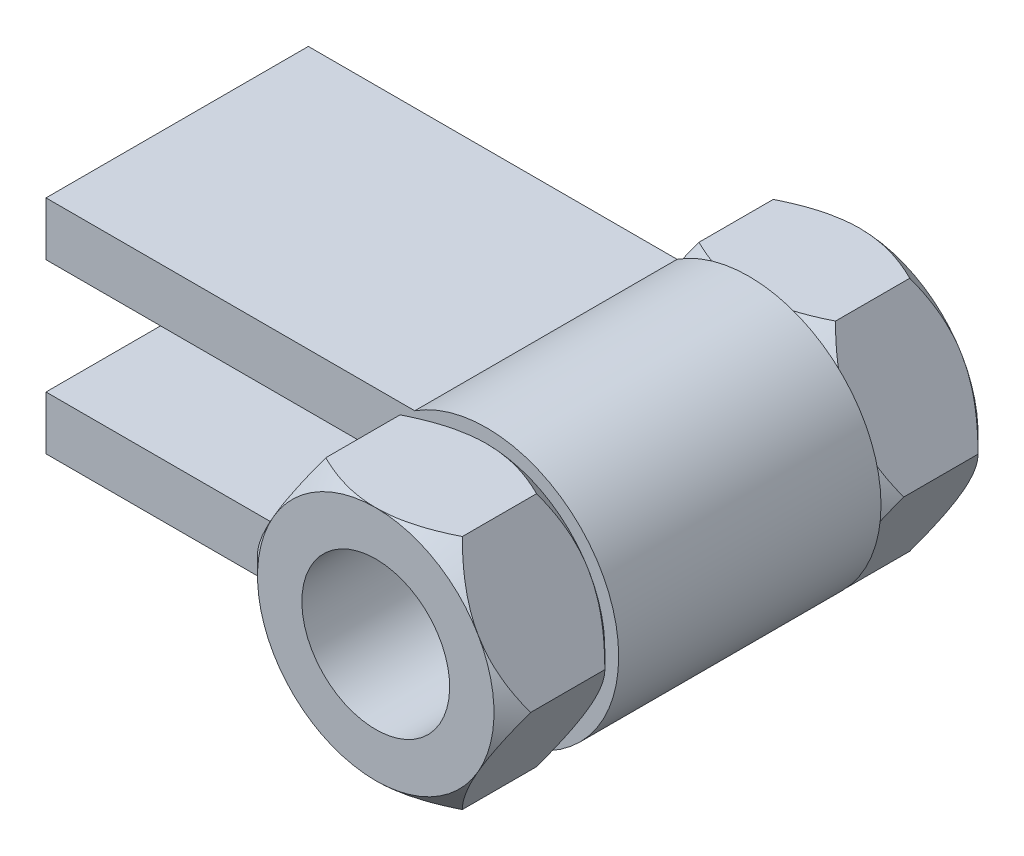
ISO-10303-21;
HEADER;
FILE_DESCRIPTION(('STEP AP214'),'2;1');
FILE_NAME('part.step','',(''),(''),'','','');
FILE_SCHEMA(('AUTOMOTIVE_DESIGN { 1 0 10303 214 1 1 1 1 }'));
ENDSEC;
DATA;
#1=APPLICATION_CONTEXT('core data for automotive mechanical design processes');
#2=APPLICATION_PROTOCOL_DEFINITION('international standard','automotive_design',2000,#1);
#3=PRODUCT_CONTEXT('',#1,'mechanical');
#4=PRODUCT('Part','Part','',(#3));
#5=PRODUCT_RELATED_PRODUCT_CATEGORY('part','',(#4));
#6=PRODUCT_DEFINITION_FORMATION('','',#4);
#7=PRODUCT_DEFINITION_CONTEXT('part definition',#1,'design');
#8=PRODUCT_DEFINITION('design','',#6,#7);
#9=PRODUCT_DEFINITION_SHAPE('','',#8);
#10=(LENGTH_UNIT() NAMED_UNIT(*) SI_UNIT(.MILLI.,.METRE.));
#11=(NAMED_UNIT(*) PLANE_ANGLE_UNIT() SI_UNIT($,.RADIAN.));
#12=(NAMED_UNIT(*) SI_UNIT($,.STERADIAN.) SOLID_ANGLE_UNIT());
#13=UNCERTAINTY_MEASURE_WITH_UNIT(LENGTH_MEASURE(1.E-05),#10,'distance_accuracy_value','');
#14=(GEOMETRIC_REPRESENTATION_CONTEXT(3) GLOBAL_UNCERTAINTY_ASSIGNED_CONTEXT((#13)) GLOBAL_UNIT_ASSIGNED_CONTEXT((#10,
#11,#12)) REPRESENTATION_CONTEXT('',''));
#15=CARTESIAN_POINT('',(0.,0.,0.));
#16=DIRECTION('',(0.,0.,1.));
#17=DIRECTION('',(1.,0.,0.));
#18=AXIS2_PLACEMENT_3D('',#15,#16,#17);
#19=CARTESIAN_POINT('',(-7.67477976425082,13.2931084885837,-7.1));
#20=DIRECTION('',(0.,0.,-1.));
#21=DIRECTION('',(0.866025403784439,0.5,0.));
#22=AXIS2_PLACEMENT_3D('',#19,#20,#21);
#23=PLANE('',#22);
#24=CARTESIAN_POINT('',(-2.08166817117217E-13,2.53269627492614E-13,-7.1));
#25=DIRECTION('',(0.,0.,-1.));
#26=DIRECTION('',(0.866025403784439,0.5,0.));
#27=AXIS2_PLACEMENT_3D('',#24,#25,#26);
#28=CIRCLE('',#27,4.);
#29=CARTESIAN_POINT('',(3.46410161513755,2.00000000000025,-7.1));
#30=VERTEX_POINT('',#29);
#31=EDGE_CURVE('E2028',#30,#30,#28,.T.);
#32=ORIENTED_EDGE('',*,*,#31,.T.);
#33=EDGE_LOOP('',(#32));
#34=FACE_BOUND('',#33,.T.);
#35=DIRECTION('',(1.,0.,0.));
#36=VECTOR('',#35,1.);
#37=CARTESIAN_POINT('',(-7.67477976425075,3.1,-7.1));
#38=LINE('',#37,#36);
#39=CARTESIAN_POINT('',(-5.59910707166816,3.1,-7.1));
#40=VERTEX_POINT('',#39);
#41=CARTESIAN_POINT('',(-2.83372546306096,3.1,-7.1));
#42=VERTEX_POINT('',#41);
#43=EDGE_CURVE('E9',#40,#42,#38,.T.);
#44=ORIENTED_EDGE('',*,*,#43,.F.);
#45=CARTESIAN_POINT('',(-2.08166817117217E-13,2.53269627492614E-13,-7.1));
#46=DIRECTION('',(0.,0.,1.));
#47=DIRECTION('',(0.866025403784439,0.5,0.));
#48=AXIS2_PLACEMENT_3D('',#45,#46,#47);
#49=CIRCLE('',#48,6.4);
#50=CARTESIAN_POINT('',(-5.59910707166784,-3.1,-7.1));
#51=VERTEX_POINT('',#50);
#52=EDGE_CURVE('E1808',#40,#51,#49,.T.);
#53=ORIENTED_EDGE('',*,*,#52,.T.);
#54=DIRECTION('',(-1.,0.,0.));
#55=VECTOR('',#54,1.);
#56=CARTESIAN_POINT('',(-7.67477976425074,-3.1,-7.1));
#57=LINE('',#56,#55);
#58=CARTESIAN_POINT('',(-2.83372546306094,-3.1,-7.1));
#59=VERTEX_POINT('',#58);
#60=EDGE_CURVE('E25',#59,#51,#57,.T.);
#61=ORIENTED_EDGE('',*,*,#60,.F.);
#62=CARTESIAN_POINT('',(0.,0.,-7.1));
#63=DIRECTION('',(0.,0.,-1.));
#64=DIRECTION('',(0.,-1.,0.));
#65=AXIS2_PLACEMENT_3D('',#62,#63,#64);
#66=CIRCLE('',#65,4.2);
#67=EDGE_CURVE('E38',#42,#59,#66,.T.);
#68=ORIENTED_EDGE('',*,*,#67,.F.);
#69=EDGE_LOOP('',(#44,#53,#61,#68));
#70=FACE_BOUND('',#69,.T.);
#71=ADVANCED_FACE('F14',(#34,#70),#23,.F.);
#72=CARTESIAN_POINT('',(-2.08166817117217E-13,2.53269627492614E-13,-13.1));
#73=DIRECTION('',(0.,0.,1.));
#74=DIRECTION('',(-0.866025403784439,-0.5,0.));
#75=AXIS2_PLACEMENT_3D('',#72,#73,#74);
#76=CYLINDRICAL_SURFACE('',#75,4.);
#77=ORIENTED_EDGE('',*,*,#31,.F.);
#78=EDGE_LOOP('',(#77));
#79=FACE_BOUND('',#78,.T.);
#80=CARTESIAN_POINT('',(-2.08166817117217E-13,2.53269627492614E-13,-13.1));
#81=DIRECTION('',(0.,0.,-1.));
#82=DIRECTION('',(0.866025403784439,0.5,0.));
#83=AXIS2_PLACEMENT_3D('',#80,#81,#82);
#84=CIRCLE('',#83,4.);
#85=CARTESIAN_POINT('',(3.46410161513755,2.00000000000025,-13.1));
#86=VERTEX_POINT('',#85);
#87=EDGE_CURVE('E1827',#86,#86,#84,.T.);
#88=ORIENTED_EDGE('',*,*,#87,.T.);
#89=EDGE_LOOP('',(#88));
#90=FACE_BOUND('',#89,.T.);
#91=ADVANCED_FACE('F1545',(#79,#90),#76,.F.);
#92=CARTESIAN_POINT('',(-7.67477976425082,6.40000000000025,-13.1));
#93=DIRECTION('',(0.,-1.,0.));
#94=DIRECTION('',(0.,0.,-1.));
#95=AXIS2_PLACEMENT_3D('',#92,#93,#94);
#96=PLANE('',#95);
#97=CARTESIAN_POINT('',(-3.69504172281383,6.40000000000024,-12.1099165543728));
#98=CARTESIAN_POINT('',(-3.59391437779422,6.39999950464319,-12.1604757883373));
#99=CARTESIAN_POINT('',(-3.49216507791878,6.39998427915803,-12.209811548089));
#100=CARTESIAN_POINT('',(-3.2899272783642,6.3999455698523,-12.3045066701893));
#101=CARTESIAN_POINT('',(-3.189470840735,6.39992230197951,-12.3499346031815));
#102=CARTESIAN_POINT('',(-2.98962482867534,6.39988706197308,-12.4368202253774));
#103=CARTESIAN_POINT('',(-2.89026482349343,6.39987483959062,-12.4783457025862));
#104=CARTESIAN_POINT('',(-2.69240413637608,6.39987056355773,-12.5574260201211));
#105=CARTESIAN_POINT('',(-2.59392962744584,6.39987808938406,-12.5950461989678));
#106=CARTESIAN_POINT('',(-2.39761372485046,6.3999107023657,-12.6663186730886));
#107=CARTESIAN_POINT('',(-2.29979438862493,6.39993546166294,-12.7000315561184));
#108=CARTESIAN_POINT('',(-2.10454832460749,6.39997893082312,-12.7634976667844));
#109=CARTESIAN_POINT('',(-2.00713891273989,6.399997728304,-12.7933040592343));
#110=CARTESIAN_POINT('',(-1.80504889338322,6.40000241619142,-12.8510700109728));
#111=CARTESIAN_POINT('',(-1.70029988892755,6.39998613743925,-12.878791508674));
#112=CARTESIAN_POINT('',(-1.49140541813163,6.39997038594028,-12.9293220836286));
#113=CARTESIAN_POINT('',(-1.38727743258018,6.39997064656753,-12.9522031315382));
#114=CARTESIAN_POINT('',(-1.1792251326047,6.39998678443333,-12.9930718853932));
#115=CARTESIAN_POINT('',(-1.07531065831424,6.40000249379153,-13.0111095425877));
#116=CARTESIAN_POINT('',(-0.863262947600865,6.39999742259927,-13.0429237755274));
#117=CARTESIAN_POINT('',(-0.755105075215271,6.39997540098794,-13.0565372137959));
#118=CARTESIAN_POINT('',(-0.539185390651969,6.39995579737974,-13.0782606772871));
#119=CARTESIAN_POINT('',(-0.431428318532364,6.39995800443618,-13.0864175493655));
#120=CARTESIAN_POINT('',(-0.215781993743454,6.39997370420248,-13.0972985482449));
#121=CARTESIAN_POINT('',(-0.107893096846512,6.39998718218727,-13.1000297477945));
#122=CARTESIAN_POINT('',(-2.09232631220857E-13,6.40000000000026,-13.1));
#123=B_SPLINE_CURVE_WITH_KNOTS('',3,(#97,#98,#99,#100,#101,#102,#103,#104,#105,#106,#107,#108,
#109,#110,#111,#112,#113,#114,#115,#116,#117,#118,#119,#120,#121,#122),.UNSPECIFIED.,.F.,.F.,(4,
2,2,2,2,2,2,2,2,2,2,2,4),(0.,0.339190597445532,0.669902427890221,0.992918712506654,
1.30911270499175,1.61945005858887,1.92498892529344,2.24996208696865,2.56969781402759,
2.88599696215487,3.21290071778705,3.5369605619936,3.86059769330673),.UNSPECIFIED.);
#124=CARTESIAN_POINT('',(-3.69504172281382,6.40000000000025,-12.1099165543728));
#125=VERTEX_POINT('',#124);
#126=CARTESIAN_POINT('',(-2.22044604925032E-13,6.40000000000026,-13.1));
#127=VERTEX_POINT('',#126);
#128=EDGE_CURVE('E2221',#125,#127,#123,.T.);
#129=ORIENTED_EDGE('',*,*,#128,.F.);
#130=DIRECTION('',(0.,0.,1.));
#131=VECTOR('',#130,1.);
#132=CARTESIAN_POINT('',(-3.69504172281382,6.40000000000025,-13.1));
#133=LINE('',#132,#131);
#134=CARTESIAN_POINT('',(-3.69504172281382,6.40000000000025,-8.09008344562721));
#135=VERTEX_POINT('',#134);
#136=EDGE_CURVE('E2042',#125,#135,#133,.T.);
#137=ORIENTED_EDGE('',*,*,#136,.T.);
#138=CARTESIAN_POINT('',(-3.69504172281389,6.40000000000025,-8.0900834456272));
#139=CARTESIAN_POINT('',(-2.75725094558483,6.40000000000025,-7.62118805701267));
#140=CARTESIAN_POINT('',(-1.909208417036,6.40000000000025,-7.37870322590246));
#141=CARTESIAN_POINT('',(-0.934499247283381,6.40000000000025,-7.1));
#142=CARTESIAN_POINT('',(-2.80157841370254E-13,6.40000000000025,-7.1));
#143=B_SPLINE_CURVE_WITH_KNOTS('',2,(#138,#139,#140,#141,#142),.UNSPECIFIED.,.F.,.F.,(3,2,3),
(0.,0.5,1.),.UNSPECIFIED.);
#144=CARTESIAN_POINT('',(-2.22044604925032E-13,6.40000000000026,-7.1));
#145=VERTEX_POINT('',#144);
#146=EDGE_CURVE('E2139',#135,#145,#143,.T.);
#147=ORIENTED_EDGE('',*,*,#146,.T.);
#148=CARTESIAN_POINT('',(-2.80157841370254E-13,6.40000000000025,-7.1));
#149=CARTESIAN_POINT('',(0.9285293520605,6.40000000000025,-7.1));
#150=CARTESIAN_POINT('',(1.89752513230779,6.40000000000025,-7.37537277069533));
#151=CARTESIAN_POINT('',(2.75032257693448,6.40000000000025,-7.61772387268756));
#152=CARTESIAN_POINT('',(3.69504172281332,6.40000000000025,-8.0900834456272));
#153=B_SPLINE_CURVE_WITH_KNOTS('',2,(#148,#149,#150,#151,#152),.UNSPECIFIED.,.F.,.F.,(3,2,3),
(0.,0.5,1.),.UNSPECIFIED.);
#154=CARTESIAN_POINT('',(3.69504172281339,6.40000000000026,-8.09008344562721));
#155=VERTEX_POINT('',#154);
#156=EDGE_CURVE('E2135',#145,#155,#153,.T.);
#157=ORIENTED_EDGE('',*,*,#156,.T.);
#158=DIRECTION('',(0.,0.,1.));
#159=VECTOR('',#158,1.);
#160=CARTESIAN_POINT('',(3.69504172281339,6.40000000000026,-13.1));
#161=LINE('',#160,#159);
#162=CARTESIAN_POINT('',(3.69504172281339,6.40000000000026,-12.1099165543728));
#163=VERTEX_POINT('',#162);
#164=EDGE_CURVE('E2140',#163,#155,#161,.T.);
#165=ORIENTED_EDGE('',*,*,#164,.F.);
#166=CARTESIAN_POINT('',(-2.09232631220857E-13,6.40000000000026,-13.1));
#167=CARTESIAN_POINT('',(0.106105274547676,6.39998754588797,-13.1000282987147));
#168=CARTESIAN_POINT('',(0.212205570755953,6.39998968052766,-13.0973722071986));
#169=CARTESIAN_POINT('',(0.424416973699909,6.40001352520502,-13.0868027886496));
#170=CARTESIAN_POINT('',(0.53052741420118,6.40003528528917,-13.0788760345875));
#171=CARTESIAN_POINT('',(0.7432732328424,6.400089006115,-13.0577749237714));
#172=CARTESIAN_POINT('',(0.849903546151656,6.4001210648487,-13.0445498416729));
#173=CARTESIAN_POINT('',(1.06089525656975,6.40012144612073,-13.0133731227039));
#174=CARTESIAN_POINT('',(1.16526719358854,6.40009068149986,-12.9954924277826));
#175=CARTESIAN_POINT('',(1.37413012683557,6.40003840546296,-12.954915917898));
#176=CARTESIAN_POINT('',(1.47861226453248,6.4000169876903,-12.9321746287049));
#177=CARTESIAN_POINT('',(1.6881128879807,6.40000111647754,-12.8819007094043));
#178=CARTESIAN_POINT('',(1.79311491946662,6.40000708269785,-12.8542997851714));
#179=CARTESIAN_POINT('',(1.99609183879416,6.39999331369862,-12.7966153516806));
#180=CARTESIAN_POINT('',(2.09413111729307,6.39997499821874,-12.7667572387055));
#181=CARTESIAN_POINT('',(2.29063810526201,6.3999303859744,-12.7031364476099));
#182=CARTESIAN_POINT('',(2.38908827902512,6.39990396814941,-12.6693197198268));
#183=CARTESIAN_POINT('',(2.58667207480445,6.39986981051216,-12.5977855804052));
#184=CARTESIAN_POINT('',(2.6857832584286,6.39986243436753,-12.560006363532));
#185=CARTESIAN_POINT('',(2.88492918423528,6.39986770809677,-12.4805550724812));
#186=CARTESIAN_POINT('',(2.98493724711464,6.39988079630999,-12.4388162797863));
#187=CARTESIAN_POINT('',(3.1860960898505,6.39991817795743,-12.351451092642));
#188=CARTESIAN_POINT('',(3.28721668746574,6.39994273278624,-12.3057554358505));
#189=CARTESIAN_POINT('',(3.4908039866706,6.3999835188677,-12.2104718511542));
#190=CARTESIAN_POINT('',(3.59323794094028,6.39999951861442,-12.1608138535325));
#191=CARTESIAN_POINT('',(3.6950417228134,6.40000000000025,-12.1099165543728));
#192=B_SPLINE_CURVE_WITH_KNOTS('',3,(#166,#167,#168,#169,#170,#171,#172,#173,#174,#175,#176,
#177,#178,#179,#180,#181,#182,#183,#184,#185,#186,#187,#188,#189,#190,#191),.UNSPECIFIED.,.F.,
.F.,(4,2,2,2,2,2,2,2,2,2,2,2,4),(0.,0.318273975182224,0.637361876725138,0.959580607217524,
1.277150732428,1.5978332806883,1.92344656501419,2.23083631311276,2.54306324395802,
2.86121056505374,3.18626639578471,3.5191238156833,3.86058328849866),.UNSPECIFIED.);
#193=EDGE_CURVE('E2220',#127,#163,#192,.T.);
#194=ORIENTED_EDGE('',*,*,#193,.F.);
#195=EDGE_LOOP('',(#129,#137,#147,#157,#165,#194));
#196=FACE_BOUND('',#195,.T.);
#197=ADVANCED_FACE('F1550',(#196),#96,.F.);
#198=CARTESIAN_POINT('',(-2.13221718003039,16.4931084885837,-13.1));
#199=DIRECTION('',(-0.866025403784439,-0.5,0.));
#200=DIRECTION('',(0.,0.,-1.));
#201=AXIS2_PLACEMENT_3D('',#198,#199,#200);
#202=PLANE('',#201);
#203=CARTESIAN_POINT('',(3.6950417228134,6.40000000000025,-12.1099165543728));
#204=CARTESIAN_POINT('',(3.74579083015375,6.31209896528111,-12.1606615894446));
#205=CARTESIAN_POINT('',(3.79684020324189,6.22364784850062,-12.2101743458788));
#206=CARTESIAN_POINT('',(3.8982963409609,6.0478418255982,-12.3051930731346));
#207=CARTESIAN_POINT('',(3.9486870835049,5.96051511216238,-12.3507684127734));
#208=CARTESIAN_POINT('',(4.04894133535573,5.78679788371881,-12.437918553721));
#209=CARTESIAN_POINT('',(4.09878967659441,5.70043312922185,-12.4795619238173));
#210=CARTESIAN_POINT('',(4.1980719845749,5.52846241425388,-12.558847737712));
#211=CARTESIAN_POINT('',(4.24749235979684,5.44287913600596,-12.5965562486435));
#212=CARTESIAN_POINT('',(4.34603094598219,5.27227173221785,-12.6679751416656));
#213=CARTESIAN_POINT('',(4.39513774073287,5.18726671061,-12.7017467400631));
#214=CARTESIAN_POINT('',(4.49315007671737,5.01759286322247,-12.7653002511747));
#215=CARTESIAN_POINT('',(4.54204697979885,4.93293917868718,-12.7951358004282));
#216=CARTESIAN_POINT('',(4.64320965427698,4.75772992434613,-12.8527865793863));
#217=CARTESIAN_POINT('',(4.69550520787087,4.66711873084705,-12.8803816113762));
#218=CARTESIAN_POINT('',(4.79981091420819,4.48642444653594,-12.9306692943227));
#219=CARTESIAN_POINT('',(4.85181217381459,4.39635622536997,-12.9534335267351));
#220=CARTESIAN_POINT('',(4.95572759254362,4.2164016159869,-12.994078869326));
#221=CARTESIAN_POINT('',(5.00763674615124,4.1265235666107,-13.0120095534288));
#222=CARTESIAN_POINT('',(5.11329823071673,3.94350269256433,-13.0435460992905));
#223=CARTESIAN_POINT('',(5.16706023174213,3.85034098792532,-13.0570108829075));
#224=CARTESIAN_POINT('',(5.27441018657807,3.6643669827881,-13.0784977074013));
#225=CARTESIAN_POINT('',(5.32799565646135,3.57155857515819,-13.0865655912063));
#226=CARTESIAN_POINT('',(5.43524125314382,3.38583453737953,-13.097327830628));
#227=CARTESIAN_POINT('',(5.48890119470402,3.2929191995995,-13.1000290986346));
#228=CARTESIAN_POINT('',(5.5425625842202,3.20000000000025,-13.1));
#229=B_SPLINE_CURVE_WITH_KNOTS('',3,(#203,#204,#205,#206,#207,#208,#209,#210,#211,#212,#213,
#214,#215,#216,#217,#218,#219,#220,#221,#222,#223,#224,#225,#226,#227,#228),.UNSPECIFIED.,.F.,
.F.,(4,2,2,2,2,2,2,2,2,2,2,2,4),(0.,0.34043747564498,0.672331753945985,0.996475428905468,
1.31375252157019,1.62514087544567,1.93171222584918,2.25621267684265,2.57550434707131,
2.8913846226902,3.21645948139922,3.53873675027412,3.86059864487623),.UNSPECIFIED.);
#230=CARTESIAN_POINT('',(5.54256258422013,3.20000000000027,-13.1));
#231=VERTEX_POINT('',#230);
#232=EDGE_CURVE('E2216',#163,#231,#229,.T.);
#233=ORIENTED_EDGE('',*,*,#232,.F.);
#234=ORIENTED_EDGE('',*,*,#164,.T.);
#235=CARTESIAN_POINT('',(3.69504172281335,6.40000000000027,-8.0900834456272));
#236=CARTESIAN_POINT('',(4.1656921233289,5.58480959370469,-7.6194330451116));
#237=CARTESIAN_POINT('',(4.5911912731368,4.84782344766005,-7.3768577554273));
#238=CARTESIAN_POINT('',(5.07682499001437,4.00668117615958,-7.1));
#239=CARTESIAN_POINT('',(5.54256258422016,3.20000000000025,-7.1));
#240=B_SPLINE_CURVE_WITH_KNOTS('',2,(#235,#236,#237,#238,#239),.UNSPECIFIED.,.F.,.F.,(3,2,3),
(0.,0.5,1.),.UNSPECIFIED.);
#241=CARTESIAN_POINT('',(5.54256258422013,3.20000000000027,-7.1));
#242=VERTEX_POINT('',#241);
#243=EDGE_CURVE('E2119',#155,#242,#240,.T.);
#244=ORIENTED_EDGE('',*,*,#243,.T.);
#245=CARTESIAN_POINT('',(5.54256258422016,3.20000000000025,-7.1));
#246=CARTESIAN_POINT('',(6.00776747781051,2.39424148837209,-7.1));
#247=CARTESIAN_POINT('',(6.49332449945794,1.55323205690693,-7.37651053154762));
#248=CARTESIAN_POINT('',(6.91881484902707,0.816261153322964,-7.61881484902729));
#249=CARTESIAN_POINT('',(7.39008344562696,2.56739074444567E-13,-8.0900834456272));
#250=B_SPLINE_CURVE_WITH_KNOTS('',2,(#245,#246,#247,#248,#249),.UNSPECIFIED.,.F.,.F.,(3,2,3),
(0.,0.5,1.),.UNSPECIFIED.);
#251=CARTESIAN_POINT('',(7.3900834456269,2.46330733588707E-13,-8.09008344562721));
#252=VERTEX_POINT('',#251);
#253=EDGE_CURVE('E2115',#242,#252,#250,.T.);
#254=ORIENTED_EDGE('',*,*,#253,.T.);
#255=DIRECTION('',(0.,0.,1.));
#256=VECTOR('',#255,1.);
#257=CARTESIAN_POINT('',(7.3900834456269,2.46330733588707E-13,-13.1));
#258=LINE('',#257,#256);
#259=CARTESIAN_POINT('',(7.3900834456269,2.46330733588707E-13,-12.1099165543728));
#260=VERTEX_POINT('',#259);
#261=EDGE_CURVE('E2120',#260,#252,#258,.T.);
#262=ORIENTED_EDGE('',*,*,#261,.F.);
#263=CARTESIAN_POINT('',(5.54256258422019,3.20000000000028,-13.1));
#264=CARTESIAN_POINT('',(5.59593205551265,3.10753584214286,-13.1000289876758));
#265=CARTESIAN_POINT('',(5.64930932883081,3.01508189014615,-13.0973428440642));
#266=CARTESIAN_POINT('',(5.75607120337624,2.83019719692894,-13.0866518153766));
#267=CARTESIAN_POINT('',(5.80945553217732,2.73776701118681,-13.0786345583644));
#268=CARTESIAN_POINT('',(5.91648822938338,2.5524741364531,-13.0572911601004));
#269=CARTESIAN_POINT('',(5.97013416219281,2.45961590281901,-13.0439144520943));
#270=CARTESIAN_POINT('',(6.07582587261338,2.27655318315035,-13.012498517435));
#271=CARTESIAN_POINT('',(6.12788090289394,2.18633523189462,-12.994568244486));
#272=CARTESIAN_POINT('',(6.23207403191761,2.00577817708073,-12.9539069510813));
#273=CARTESIAN_POINT('',(6.28420767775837,1.91544702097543,-12.9311293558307));
#274=CARTESIAN_POINT('',(6.38877691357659,1.73431013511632,-12.8807978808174));
#275=CARTESIAN_POINT('',(6.44120448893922,1.64351905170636,-12.8531749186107));
#276=CARTESIAN_POINT('',(6.54249319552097,1.4680575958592,-12.7954849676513));
#277=CARTESIAN_POINT('',(6.59138817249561,1.38333175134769,-12.7656449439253));
#278=CARTESIAN_POINT('',(6.68938616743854,1.21350524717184,-12.7020778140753));
#279=CARTESIAN_POINT('',(6.73848035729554,1.12841965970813,-12.6682969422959));
#280=CARTESIAN_POINT('',(6.83702551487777,0.957667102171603,-12.5968526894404));
#281=CARTESIAN_POINT('',(6.88646563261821,0.872019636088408,-12.5591278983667));
#282=CARTESIAN_POINT('',(6.98582310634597,0.699937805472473,-12.4798033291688));
#283=CARTESIAN_POINT('',(7.03572758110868,0.613526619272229,-12.4381372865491));
#284=CARTESIAN_POINT('',(7.1361149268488,0.439724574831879,-12.3509354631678));
#285=CARTESIAN_POINT('',(7.18658303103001,0.352359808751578,-12.3053309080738));
#286=CARTESIAN_POINT('',(7.28818186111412,0.176466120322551,-12.2102474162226));
#287=CARTESIAN_POINT('',(7.33929612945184,0.0879652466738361,-12.1606989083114));
#288=CARTESIAN_POINT('',(7.390083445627,2.6803798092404E-13,-12.1099165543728));
#289=B_SPLINE_CURVE_WITH_KNOTS('',3,(#263,#264,#265,#266,#267,#268,#269,#270,#271,#272,#273,
#274,#275,#276,#277,#278,#279,#280,#281,#282,#283,#284,#285,#286,#287,#288),.UNSPECIFIED.,.F.,
.F.,(4,2,2,2,2,2,2,2,2,2,2,2,4),(0.,0.320240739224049,0.641227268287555,0.965316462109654,
1.28228162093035,1.6024421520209,1.92760628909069,2.23435788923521,2.5459352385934,
2.86341305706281,3.18777184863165,3.51989796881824,3.86058603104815),.UNSPECIFIED.);
#290=EDGE_CURVE('E291',#231,#260,#289,.T.);
#291=ORIENTED_EDGE('',*,*,#290,.F.);
#292=EDGE_LOOP('',(#233,#234,#244,#254,#262,#291));
#293=FACE_BOUND('',#292,.T.);
#294=ADVANCED_FACE('F1564',(#293),#202,.F.);
#295=CARTESIAN_POINT('',(9.37995246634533,3.44655424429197,-13.1));
#296=DIRECTION('',(-0.866025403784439,0.5,0.));
#297=DIRECTION('',(-0.5,-0.866025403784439,0.));
#298=AXIS2_PLACEMENT_3D('',#295,#296,#297);
#299=PLANE('',#298);
#300=CARTESIAN_POINT('',(7.390083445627,2.6803798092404E-13,-12.1099165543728));
#301=CARTESIAN_POINT('',(7.33951934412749,-0.0875786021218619,-12.1604757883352));
#302=CARTESIAN_POINT('',(7.28863150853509,-0.175688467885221,-12.2098115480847));
#303=CARTESIAN_POINT('',(7.18747908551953,-0.350812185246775,-12.3045066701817));
#304=CARTESIAN_POINT('',(7.13723071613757,-0.437798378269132,-12.3499346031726));
#305=CARTESIAN_POINT('',(7.03727719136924,-0.610852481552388,-12.4368202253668));
#306=CARTESIAN_POINT('',(6.9875866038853,-0.696894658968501,-12.4783457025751));
#307=CARTESIAN_POINT('',(6.88865255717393,-0.86824490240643,-12.55742602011));
#308=CARTESIAN_POINT('',(6.8394218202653,-0.953530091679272,-12.5950461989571));
#309=CARTESIAN_POINT('',(6.74129211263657,-1.12356095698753,-12.6663186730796));
#310=CARTESIAN_POINT('',(6.69240388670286,-1.20828736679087,-12.7000315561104));
#311=CARTESIAN_POINT('',(6.5948185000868,-1.37739715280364,-12.7634976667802));
#312=CARTESIAN_POINT('',(6.54613007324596,-1.46176557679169,-12.7933040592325));
#313=CARTESIAN_POINT('',(6.44508912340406,-1.63678301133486,-12.8510700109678));
#314=CARTESIAN_POINT('',(6.39270052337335,-1.72749017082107,-12.8787915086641));
#315=CARTESIAN_POINT('',(6.28823964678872,-1.90839021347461,-12.9293220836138));
#316=CARTESIAN_POINT('',(6.23617587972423,-1.99856782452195,-12.9522031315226));
#317=CARTESIAN_POINT('',(6.13216370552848,-2.17875447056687,-12.9930718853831));
#318=CARTESIAN_POINT('',(6.08022007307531,-2.26875489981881,-13.011109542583));
#319=CARTESIAN_POINT('',(5.97419182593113,-2.45239106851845,-13.0429237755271));
#320=CARTESIAN_POINT('',(5.92009381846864,-2.54604752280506,-13.0565372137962));
#321=CARTESIAN_POINT('',(5.81211699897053,-2.73302965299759,-13.0782606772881));
#322=CARTESIAN_POINT('',(5.7582403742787,-2.82635111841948,-13.086417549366));
#323=CARTESIAN_POINT('',(5.65043080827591,-3.01311416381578,-13.0972985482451));
#324=CARTESIAN_POINT('',(5.59649803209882,-3.10655542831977,-13.1000297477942));
#325=CARTESIAN_POINT('',(5.5425625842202,-3.19999999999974,-13.1));
#326=B_SPLINE_CURVE_WITH_KNOTS('',3,(#300,#301,#302,#303,#304,#305,#306,#307,#308,#309,#310,
#311,#312,#313,#314,#315,#316,#317,#318,#319,#320,#321,#322,#323,#324,#325),.UNSPECIFIED.,.F.,
.F.,(4,2,2,2,2,2,2,2,2,2,2,2,4),(0.,0.339190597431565,0.669902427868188,0.992918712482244,
1.30911270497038,1.61945005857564,1.92498892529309,2.24996208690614,2.56969781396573,
2.88599696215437,3.2129007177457,3.53696056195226,3.86059769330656),.UNSPECIFIED.);
#327=CARTESIAN_POINT('',(5.54256258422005,-3.19999999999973,-13.1));
#328=VERTEX_POINT('',#327);
#329=EDGE_CURVE('E284',#260,#328,#326,.T.);
#330=ORIENTED_EDGE('',*,*,#329,.F.);
#331=ORIENTED_EDGE('',*,*,#261,.T.);
#332=CARTESIAN_POINT('',(7.39008344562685,2.39391839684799E-13,-8.0900834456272));
#333=CARTESIAN_POINT('',(6.92118805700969,-0.81215063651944,-7.62118805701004));
#334=CARTESIAN_POINT('',(6.49716679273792,-1.54657700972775,-7.37870322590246));
#335=CARTESIAN_POINT('',(6.00981220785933,-2.3906999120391,-7.1));
#336=CARTESIAN_POINT('',(5.54256258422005,-3.19999999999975,-7.1));
#337=B_SPLINE_CURVE_WITH_KNOTS('',2,(#332,#333,#334,#335,#336),.UNSPECIFIED.,.F.,.F.,(3,2,3),
(0.,0.5,1.),.UNSPECIFIED.);
#338=CARTESIAN_POINT('',(5.54256258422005,-3.19999999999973,-7.1));
#339=VERTEX_POINT('',#338);
#340=EDGE_CURVE('E2127',#252,#339,#337,.T.);
#341=ORIENTED_EDGE('',*,*,#340,.T.);
#342=CARTESIAN_POINT('',(5.54256258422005,-3.19999999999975,-7.1));
#343=CARTESIAN_POINT('',(5.07829790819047,-4.0041300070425,-7.1));
#344=CARTESIAN_POINT('',(4.59380001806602,-4.84330496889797,-7.37537277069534));
#345=CARTESIAN_POINT('',(4.16740129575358,-5.58184922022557,-7.61772387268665));
#346=CARTESIAN_POINT('',(3.69504172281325,-6.39999999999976,-8.09008344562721));
#347=B_SPLINE_CURVE_WITH_KNOTS('',2,(#342,#343,#344,#345,#346),.UNSPECIFIED.,.F.,.F.,(3,2,3),
(0.,0.5,1.),.UNSPECIFIED.);
#348=CARTESIAN_POINT('',(3.6950417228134,-6.39999999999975,-8.09008344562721));
#349=VERTEX_POINT('',#348);
#350=EDGE_CURVE('E2123',#339,#349,#347,.T.);
#351=ORIENTED_EDGE('',*,*,#350,.T.);
#352=DIRECTION('',(0.,0.,1.));
#353=VECTOR('',#352,1.);
#354=CARTESIAN_POINT('',(3.6950417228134,-6.39999999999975,-13.1));
#355=LINE('',#354,#353);
#356=CARTESIAN_POINT('',(3.6950417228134,-6.39999999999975,-12.1099165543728));
#357=VERTEX_POINT('',#356);
#358=EDGE_CURVE('E2104',#357,#349,#355,.T.);
#359=ORIENTED_EDGE('',*,*,#358,.F.);
#360=CARTESIAN_POINT('',(5.5425625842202,-3.19999999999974,-13.1));
#361=CARTESIAN_POINT('',(5.4894991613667,-3.29188363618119,-13.1000282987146));
#362=CARTESIAN_POINT('',(5.43645086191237,-3.38377025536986,-13.0973722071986));
#363=CARTESIAN_POINT('',(5.33036581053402,-3.56756264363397,-13.0868027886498));
#364=CARTESIAN_POINT('',(5.27732943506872,-3.65946786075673,-13.0788760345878));
#365=CARTESIAN_POINT('',(5.17100304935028,-3.8437380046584,-13.0577749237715));
#366=CARTESIAN_POINT('',(5.11771565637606,-3.93609859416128,-13.0445498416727));
#367=CARTESIAN_POINT('',(5.01222013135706,-4.11882296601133,-13.0133731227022));
#368=CARTESIAN_POINT('',(4.96000751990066,-4.20919633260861,-12.995492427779));
#369=CARTESIAN_POINT('',(4.8555307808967,-4.39005080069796,-12.9549159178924));
#370=CARTESIAN_POINT('',(4.80327116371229,-4.48052427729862,-12.9321746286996));
#371=CARTESIAN_POINT('',(4.69850710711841,-4.66194920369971,-12.8819007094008));
#372=CARTESIAN_POINT('',(4.64601125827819,-4.75288661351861,-12.8542997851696));
#373=CARTESIAN_POINT('',(4.54451087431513,-4.92866289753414,-12.7966153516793));
#374=CARTESIAN_POINT('',(4.49547537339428,-5.01355824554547,-12.7667572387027));
#375=CARTESIAN_POINT('',(4.39718324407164,-5.18371598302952,-12.7031364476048));
#376=CARTESIAN_POINT('',(4.3479352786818,-5.2689631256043,-12.669319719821));
#377=CARTESIAN_POINT('',(4.24911379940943,-5.44005863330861,-12.5977855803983));
#378=CARTESIAN_POINT('',(4.19955181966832,-5.52588774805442,-12.5600063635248));
#379=CARTESIAN_POINT('',(4.09998342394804,-5.69835581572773,-12.480555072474));
#380=CARTESIAN_POINT('',(4.04999072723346,-5.78497188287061,-12.4388162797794));
#381=CARTESIAN_POINT('',(3.94944367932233,-5.95919924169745,-12.3514510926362));
#382=CARTESIAN_POINT('',(3.89890464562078,-6.04678452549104,-12.3057554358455));
#383=CARTESIAN_POINT('',(3.79714631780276,-6.22311669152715,-12.2104718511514));
#384=CARTESIAN_POINT('',(3.74594319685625,-6.31183509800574,-12.1608138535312));
#385=CARTESIAN_POINT('',(3.6950417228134,-6.39999999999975,-12.1099165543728));
#386=B_SPLINE_CURVE_WITH_KNOTS('',3,(#360,#361,#362,#363,#364,#365,#366,#367,#368,#369,#370,
#371,#372,#373,#374,#375,#376,#377,#378,#379,#380,#381,#382,#383,#384,#385),.UNSPECIFIED.,.F.,
.F.,(4,2,2,2,2,2,2,2,2,2,2,2,4),(0.,0.318273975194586,0.637361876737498,0.959580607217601,
1.27715073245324,1.59783328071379,1.9234465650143,2.23083631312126,2.54306324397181,
2.86121056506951,3.18626639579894,3.51912381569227,3.86058328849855),.UNSPECIFIED.);
#387=EDGE_CURVE('E1705',#328,#357,#386,.T.);
#388=ORIENTED_EDGE('',*,*,#387,.F.);
#389=EDGE_LOOP('',(#330,#331,#341,#351,#359,#388));
#390=FACE_BOUND('',#389,.T.);
#391=ADVANCED_FACE('F1559',(#390),#299,.F.);
#392=CARTESIAN_POINT('',(-7.67477976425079,-6.39999999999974,-13.1));
#393=DIRECTION('',(0.,1.,0.));
#394=DIRECTION('',(0.,0.,1.));
#395=AXIS2_PLACEMENT_3D('',#392,#393,#394);
#396=PLANE('',#395);
#397=CARTESIAN_POINT('',(3.6950417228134,-6.39999999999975,-12.1099165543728));
#398=CARTESIAN_POINT('',(3.59391437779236,-6.39999950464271,-12.160475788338));
#399=CARTESIAN_POINT('',(3.49216507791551,-6.39998427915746,-12.2098115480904));
#400=CARTESIAN_POINT('',(3.2899272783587,-6.39994556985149,-12.3045066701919));
#401=CARTESIAN_POINT('',(3.18947084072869,-6.39992230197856,-12.3499346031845));
#402=CARTESIAN_POINT('',(2.98962482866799,-6.39988706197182,-12.4368202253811));
#403=CARTESIAN_POINT('',(2.89026482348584,-6.39987483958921,-12.47834570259));
#404=CARTESIAN_POINT('',(2.69240413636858,-6.3998705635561,-12.5574260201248));
#405=CARTESIAN_POINT('',(2.59392962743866,-6.39987808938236,-12.5950461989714));
#406=CARTESIAN_POINT('',(2.39761372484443,-6.39991070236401,-12.6663186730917));
#407=CARTESIAN_POINT('',(2.29979438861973,-6.39993546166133,-12.700031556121));
#408=CARTESIAN_POINT('',(2.10454832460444,-6.39997893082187,-12.763497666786));
#409=CARTESIAN_POINT('',(2.00713891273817,-6.39999772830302,-12.7933040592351));
#410=CARTESIAN_POINT('',(1.80504889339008,-6.40000241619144,-12.8510700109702));
#411=CARTESIAN_POINT('',(1.70029988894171,-6.39998613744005,-12.8787915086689));
#412=CARTESIAN_POINT('',(1.49140541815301,-6.39997038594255,-12.9293220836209));
#413=CARTESIAN_POINT('',(1.3872774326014,-6.3999706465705,-12.9522031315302));
#414=CARTESIAN_POINT('',(1.17922513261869,-6.39998678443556,-12.993071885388));
#415=CARTESIAN_POINT('',(1.07531065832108,-6.40000249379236,-13.0111095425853));
#416=CARTESIAN_POINT('',(0.863262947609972,-6.3999974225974,-13.0429237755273));
#417=CARTESIAN_POINT('',(0.755105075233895,-6.39997540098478,-13.0565372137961));
#418=CARTESIAN_POINT('',(0.53918539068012,-6.39995579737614,-13.0782606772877));
#419=CARTESIAN_POINT('',(0.431428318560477,-6.3999580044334,-13.0864175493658));
#420=CARTESIAN_POINT('',(0.215781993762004,-6.39997370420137,-13.0972985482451));
#421=CARTESIAN_POINT('',(0.107893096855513,-6.39998718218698,-13.1000297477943));
#422=CARTESIAN_POINT('',(-2.18114415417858E-13,-6.39999999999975,-13.1));
#423=B_SPLINE_CURVE_WITH_KNOTS('',3,(#397,#398,#399,#400,#401,#402,#403,#404,#405,#406,#407,
#408,#409,#410,#411,#412,#413,#414,#415,#416,#417,#418,#419,#420,#421,#422),.UNSPECIFIED.,.F.,
.F.,(4,2,2,2,2,2,2,2,2,2,2,2,4),(0.,0.339190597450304,0.669902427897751,0.992918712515,
1.30911270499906,1.61945005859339,1.92498892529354,2.24996208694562,2.56969781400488,
2.88599696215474,3.21290071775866,3.53696056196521,3.86059769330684),.UNSPECIFIED.);
#424=CARTESIAN_POINT('',(-1.94289029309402E-13,-6.39999999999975,-13.1));
#425=VERTEX_POINT('',#424);
#426=EDGE_CURVE('E1680',#357,#425,#423,.T.);
#427=ORIENTED_EDGE('',*,*,#426,.F.);
#428=ORIENTED_EDGE('',*,*,#358,.T.);
#429=CARTESIAN_POINT('',(3.69504172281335,-6.39999999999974,-8.09008344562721));
#430=CARTESIAN_POINT('',(2.75725094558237,-6.39999999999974,-7.62118805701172));
#431=CARTESIAN_POINT('',(1.90920841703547,-6.39999999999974,-7.37870322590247));
#432=CARTESIAN_POINT('',(0.93449924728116,-6.39999999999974,-7.1));
#433=CARTESIAN_POINT('',(-2.60208521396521E-13,-6.39999999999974,-7.1));
#434=B_SPLINE_CURVE_WITH_KNOTS('',2,(#429,#430,#431,#432,#433),.UNSPECIFIED.,.F.,.F.,(3,2,3),
(0.,0.5,1.),.UNSPECIFIED.);
#435=CARTESIAN_POINT('',(-1.94289029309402E-13,-6.39999999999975,-7.1));
#436=VERTEX_POINT('',#435);
#437=EDGE_CURVE('E2101',#349,#436,#434,.T.);
#438=ORIENTED_EDGE('',*,*,#437,.T.);
#439=CARTESIAN_POINT('',(-2.60208521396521E-13,-6.39999999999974,-7.1));
#440=CARTESIAN_POINT('',(-0.92852935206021,-6.39999999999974,-7.1));
#441=CARTESIAN_POINT('',(-1.89752513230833,-6.39999999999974,-7.37537277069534));
#442=CARTESIAN_POINT('',(-2.7503225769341,-6.39999999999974,-7.61772387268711));
#443=CARTESIAN_POINT('',(-3.69504172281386,-6.39999999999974,-8.09008344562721));
#444=B_SPLINE_CURVE_WITH_KNOTS('',2,(#439,#440,#441,#442,#443),.UNSPECIFIED.,.F.,.F.,(3,2,3),
(0.,0.5,1.),.UNSPECIFIED.);
#445=CARTESIAN_POINT('',(-3.69504172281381,-6.39999999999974,-8.09008344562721));
#446=VERTEX_POINT('',#445);
#447=EDGE_CURVE('E1778',#436,#446,#444,.T.);
#448=ORIENTED_EDGE('',*,*,#447,.T.);
#449=DIRECTION('',(0.,0.,1.));
#450=VECTOR('',#449,1.);
#451=CARTESIAN_POINT('',(-3.69504172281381,-6.39999999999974,-13.1));
#452=LINE('',#451,#450);
#453=CARTESIAN_POINT('',(-3.69504172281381,-6.39999999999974,-12.1099165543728));
#454=VERTEX_POINT('',#453);
#455=EDGE_CURVE('E1783',#454,#446,#452,.T.);
#456=ORIENTED_EDGE('',*,*,#455,.F.);
#457=CARTESIAN_POINT('',(-2.18114415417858E-13,-6.39999999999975,-13.1));
#458=CARTESIAN_POINT('',(-0.106105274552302,-6.39998754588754,-13.1000282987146));
#459=CARTESIAN_POINT('',(-0.212205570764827,-6.39998968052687,-13.0973722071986));
#460=CARTESIAN_POINT('',(-0.424416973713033,-6.40001352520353,-13.0868027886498));
#461=CARTESIAN_POINT('',(-0.530527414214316,-6.40003528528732,-13.0788760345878));
#462=CARTESIAN_POINT('',(-0.743273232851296,-6.40008900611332,-13.0577749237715));
#463=CARTESIAN_POINT('',(-0.849903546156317,-6.40012106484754,-13.0445498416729));
#464=CARTESIAN_POINT('',(-1.06089525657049,-6.40012144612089,-13.0133731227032));
#465=CARTESIAN_POINT('',(-1.16526719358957,-6.4000906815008,-12.995492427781));
#466=CARTESIAN_POINT('',(-1.37413012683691,-6.40003840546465,-12.9549159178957));
#467=CARTESIAN_POINT('',(-1.47861226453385,-6.40001698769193,-12.9321746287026));
#468=CARTESIAN_POINT('',(-1.68811288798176,-6.40000111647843,-12.8819007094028));
#469=CARTESIAN_POINT('',(-1.79311491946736,-6.40000708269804,-12.8542997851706));
#470=CARTESIAN_POINT('',(-1.99609183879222,-6.39999331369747,-12.7966153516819));
#471=CARTESIAN_POINT('',(-2.09413111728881,-6.39997499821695,-12.7667572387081));
#472=CARTESIAN_POINT('',(-2.29063810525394,-6.39993038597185,-12.7031364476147));
#473=CARTESIAN_POINT('',(-2.38908827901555,-6.39990396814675,-12.6693197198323));
#474=CARTESIAN_POINT('',(-2.58667207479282,-6.39986981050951,-12.5977855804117));
#475=CARTESIAN_POINT('',(-2.68578325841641,-6.39986243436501,-12.5600063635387));
#476=CARTESIAN_POINT('',(-2.88492918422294,-6.39986770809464,-12.480555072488));
#477=CARTESIAN_POINT('',(-2.9849372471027,-6.39988079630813,-12.4388162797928));
#478=CARTESIAN_POINT('',(-3.18609608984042,-6.39991817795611,-12.3514510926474));
#479=CARTESIAN_POINT('',(-3.2872166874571,-6.3999427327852,-12.3057554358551));
#480=CARTESIAN_POINT('',(-3.49080398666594,-6.39998351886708,-12.2104718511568));
#481=CARTESIAN_POINT('',(-3.59323794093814,-6.39999951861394,-12.1608138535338));
#482=CARTESIAN_POINT('',(-3.6950417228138,-6.39999999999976,-12.1099165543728));
#483=B_SPLINE_CURVE_WITH_KNOTS('',3,(#457,#458,#459,#460,#461,#462,#463,#464,#465,#466,#467,
#468,#469,#470,#471,#472,#473,#474,#475,#476,#477,#478,#479,#480,#481,#482),.UNSPECIFIED.,.F.,
.F.,(4,2,2,2,2,2,2,2,2,2,2,2,4),(0.,0.318273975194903,0.63736187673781,0.959580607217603,
1.27715073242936,1.59783328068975,1.92344656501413,2.23083631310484,2.54306324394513,
2.86121056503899,3.1862663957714,3.5191238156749,3.86058328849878),.UNSPECIFIED.);
#484=EDGE_CURVE('E2244',#425,#454,#483,.T.);
#485=ORIENTED_EDGE('',*,*,#484,.F.);
#486=EDGE_LOOP('',(#427,#428,#438,#448,#456,#485));
#487=FACE_BOUND('',#486,.T.);
#488=ADVANCED_FACE('F1457',(#487),#396,.F.);
#489=CARTESIAN_POINT('',(-13.2173423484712,10.0931084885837,-13.1));
#490=DIRECTION('',(0.866025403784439,0.5,0.));
#491=DIRECTION('',(0.,0.,-1.));
#492=AXIS2_PLACEMENT_3D('',#489,#490,#491);
#493=PLANE('',#492);
#494=CARTESIAN_POINT('',(-3.6950417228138,-6.39999999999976,-12.1099165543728));
#495=CARTESIAN_POINT('',(-3.74582587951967,-6.31203829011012,-12.1606965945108));
#496=CARTESIAN_POINT('',(-3.79691066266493,-6.22352571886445,-12.2102427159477));
#497=CARTESIAN_POINT('',(-3.89843666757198,-6.04759838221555,-12.3053224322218));
#498=CARTESIAN_POINT('',(-3.94886183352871,-5.96021186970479,-12.3509255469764));
#499=CARTESIAN_POINT('',(-4.04918430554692,-5.78637630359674,-12.4381254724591));
#500=CARTESIAN_POINT('',(-4.09906641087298,-5.69995306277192,-12.4797910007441));
#501=CARTESIAN_POINT('',(-4.19841565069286,-5.52786617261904,-12.5591155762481));
#502=CARTESIAN_POINT('',(-4.24786917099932,-5.44222524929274,-12.5968408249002));
#503=CARTESIAN_POINT('',(-4.34647457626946,-5.27150312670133,-12.6682868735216));
#504=CARTESIAN_POINT('',(-4.39561501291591,-5.18644105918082,-12.7020690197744));
#505=CARTESIAN_POINT('',(-4.49369221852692,-5.01665229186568,-12.7656401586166));
#506=CARTESIAN_POINT('',(-4.54262037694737,-4.9319407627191,-12.7954828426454));
#507=CARTESIAN_POINT('',(-4.64392347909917,-4.75649912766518,-12.8531717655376));
#508=CARTESIAN_POINT('',(-4.69632949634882,-4.66571217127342,-12.8807917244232));
#509=CARTESIAN_POINT('',(-4.80090765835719,-4.48459687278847,-12.9311202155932));
#510=CARTESIAN_POINT('',(-4.85307117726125,-4.39428265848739,-12.9538972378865));
#511=CARTESIAN_POINT('',(-4.95734935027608,-4.21375821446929,-12.9945619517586));
#512=CARTESIAN_POINT('',(-5.00945942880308,-4.12355571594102,-13.0124955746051));
#513=CARTESIAN_POINT('',(-5.11515259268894,-3.94048571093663,-13.0439142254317));
#514=CARTESIAN_POINT('',(-5.16874263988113,-3.84760358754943,-13.0572913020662));
#515=CARTESIAN_POINT('',(-5.27569062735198,-3.66227018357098,-13.078635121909));
#516=CARTESIAN_POINT('',(-5.32904592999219,-3.5698232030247,-13.0866520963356));
#517=CARTESIAN_POINT('',(-5.43578459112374,-3.38491671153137,-13.0973429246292));
#518=CARTESIAN_POINT('',(-5.48916761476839,-3.29245769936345,-13.1000287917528));
#519=CARTESIAN_POINT('',(-5.54256258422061,-3.19999999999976,-13.1));
#520=B_SPLINE_CURVE_WITH_KNOTS('',3,(#494,#495,#496,#497,#498,#499,#500,#501,#502,#503,#504,
#505,#506,#507,#508,#509,#510,#511,#512,#513,#514,#515,#516,#517,#518,#519),.UNSPECIFIED.,.F.,
.F.,(4,2,2,2,2,2,2,2,2,2,2,2,4),(0.,0.340672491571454,0.672789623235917,0.99714576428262,
1.31462697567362,1.62621341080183,1.93297937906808,2.25809953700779,2.57826048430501,
2.8952691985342,3.21933690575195,3.54032343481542,3.86058581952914),.UNSPECIFIED.);
#521=CARTESIAN_POINT('',(-5.54256258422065,-3.19999999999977,-13.1));
#522=VERTEX_POINT('',#521);
#523=EDGE_CURVE('E1721',#454,#522,#520,.T.);
#524=ORIENTED_EDGE('',*,*,#523,.F.);
#525=ORIENTED_EDGE('',*,*,#455,.T.);
#526=CARTESIAN_POINT('',(-3.69504172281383,-6.39999999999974,-8.09008344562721));
#527=CARTESIAN_POINT('',(-4.16602245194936,-5.58423744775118,-7.61910271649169));
#528=CARTESIAN_POINT('',(-4.59180066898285,-4.84676794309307,-7.37651053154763));
#529=CARTESIAN_POINT('',(-5.07710962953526,-4.00618816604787,-7.1));
#530=CARTESIAN_POINT('',(-5.54256258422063,-3.19999999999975,-7.1));
#531=B_SPLINE_CURVE_WITH_KNOTS('',2,(#526,#527,#528,#529,#530),.UNSPECIFIED.,.F.,.F.,(3,2,3),
(0.,0.5,1.),.UNSPECIFIED.);
#532=CARTESIAN_POINT('',(-5.54256258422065,-3.19999999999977,-7.1));
#533=VERTEX_POINT('',#532);
#534=EDGE_CURVE('E2132',#446,#533,#531,.T.);
#535=ORIENTED_EDGE('',*,*,#534,.T.);
#536=CARTESIAN_POINT('',(-5.54256258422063,-3.19999999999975,-7.1));
#537=CARTESIAN_POINT('',(-6.0080554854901,-2.39374264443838,-7.1));
#538=CARTESIAN_POINT('',(-6.49393389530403,-1.55217655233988,-7.37685775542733));
#539=CARTESIAN_POINT('',(-6.91914907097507,-0.815682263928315,-7.61914907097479));
#540=CARTESIAN_POINT('',(-7.39008344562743,2.48065457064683E-13,-8.0900834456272));
#541=B_SPLINE_CURVE_WITH_KNOTS('',2,(#536,#537,#538,#539,#540),.UNSPECIFIED.,.F.,.F.,(3,2,3),
(0.,0.5,1.),.UNSPECIFIED.);
#542=CARTESIAN_POINT('',(-7.3900834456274,2.56739074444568E-13,-8.09008344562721));
#543=VERTEX_POINT('',#542);
#544=EDGE_CURVE('E2187',#533,#543,#541,.T.);
#545=ORIENTED_EDGE('',*,*,#544,.T.);
#546=DIRECTION('',(0.,0.,1.));
#547=VECTOR('',#546,1.);
#548=CARTESIAN_POINT('',(-7.3900834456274,2.56739074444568E-13,-13.1));
#549=LINE('',#548,#547);
#550=CARTESIAN_POINT('',(-7.3900834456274,2.56739074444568E-13,-12.1099165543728));
#551=VERTEX_POINT('',#550);
#552=EDGE_CURVE('E2190',#551,#543,#549,.T.);
#553=ORIENTED_EDGE('',*,*,#552,.F.);
#554=CARTESIAN_POINT('',(-5.54256258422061,-3.19999999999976,-13.1));
#555=CARTESIAN_POINT('',(-5.59619848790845,-3.10707440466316,-13.1000292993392));
#556=CARTESIAN_POINT('',(-5.649832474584,-3.01415251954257,-13.0973277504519));
#557=CARTESIAN_POINT('',(-5.75704888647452,-2.82842008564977,-13.0865653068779));
#558=CARTESIAN_POINT('',(-5.81063114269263,-2.73560985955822,-13.0784971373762));
#559=CARTESIAN_POINT('',(-5.91801765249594,-2.54964852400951,-13.0570107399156));
#560=CARTESIAN_POINT('',(-5.97181974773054,-2.45650153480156,-13.0435463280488));
#561=CARTESIAN_POINT('',(-6.07748476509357,-2.27349076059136,-13.0120125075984));
#562=CARTESIAN_POINT('',(-6.12935927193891,-2.18360902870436,-12.9940851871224));
#563=CARTESIAN_POINT('',(-6.23324027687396,-2.00365103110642,-12.9534432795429));
#564=CARTESIAN_POINT('',(-6.28524201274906,-1.91358339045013,-12.9306784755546));
#565=CARTESIAN_POINT('',(-6.38958287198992,-1.73289297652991,-12.8803877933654));
#566=CARTESIAN_POINT('',(-6.44191347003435,-1.64228545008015,-12.8527897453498));
#567=CARTESIAN_POINT('',(-6.5430711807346,-1.46706178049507,-12.7951379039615));
#568=CARTESIAN_POINT('',(-6.59193172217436,-1.38239189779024,-12.765304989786));
#569=CARTESIAN_POINT('',(-6.68986267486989,-1.21267898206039,-12.701755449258));
#570=CARTESIAN_POINT('',(-6.7389242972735,-1.12765103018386,-12.6679851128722));
#571=CARTESIAN_POINT('',(-6.83740353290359,-0.957013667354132,-12.5965679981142));
#572=CARTESIAN_POINT('',(-6.88681030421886,-0.871423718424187,-12.5588599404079));
#573=CARTESIAN_POINT('',(-6.98610062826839,-0.699457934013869,-12.4795741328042));
#574=CARTESIAN_POINT('',(-7.03597132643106,-0.613105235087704,-12.4379302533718));
#575=CARTESIAN_POINT('',(-7.13629027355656,-0.439421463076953,-12.3507782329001));
#576=CARTESIAN_POINT('',(-7.18672378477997,-0.352116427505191,-12.3052014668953));
#577=CARTESIAN_POINT('',(-7.28825244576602,-0.176343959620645,-12.2101790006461));
#578=CARTESIAN_POINT('',(-7.33933117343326,-0.0879045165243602,-12.1606638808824));
#579=CARTESIAN_POINT('',(-7.39008344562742,2.50398003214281E-13,-12.1099165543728));
#580=B_SPLINE_CURVE_WITH_KNOTS('',3,(#554,#555,#556,#557,#558,#559,#560,#561,#562,#563,#564,
#565,#566,#567,#568,#569,#570,#571,#572,#573,#574,#575,#576,#577,#578,#579),.UNSPECIFIED.,.F.,
.F.,(4,2,2,2,2,2,2,2,2,2,2,2,4),(0.,0.321840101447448,0.644117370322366,0.969213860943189,
1.28505059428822,1.60434184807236,1.92888626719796,2.23544338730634,2.54682274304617,
2.86409647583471,3.18824277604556,3.52014595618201,3.86059885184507),.UNSPECIFIED.);
#581=EDGE_CURVE('E2107',#522,#551,#580,.T.);
#582=ORIENTED_EDGE('',*,*,#581,.F.);
#583=EDGE_LOOP('',(#524,#525,#535,#545,#553,#582));
#584=FACE_BOUND('',#583,.T.);
#585=ADVANCED_FACE('F1451',(#584),#493,.F.);
#586=CARTESIAN_POINT('',(-1.70517270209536,9.84655424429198,-13.1));
#587=DIRECTION('',(0.866025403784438,-0.5,0.));
#588=DIRECTION('',(0.,0.,1.));
#589=AXIS2_PLACEMENT_3D('',#586,#587,#588);
#590=PLANE('',#589);
#591=CARTESIAN_POINT('',(-7.39008344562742,2.50398003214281E-13,-12.1099165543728));
#592=CARTESIAN_POINT('',(-7.33951934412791,0.0875786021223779,-12.1604757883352));
#593=CARTESIAN_POINT('',(-7.28863150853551,0.175688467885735,-12.2098115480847));
#594=CARTESIAN_POINT('',(-7.18747908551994,0.350812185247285,-12.3045066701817));
#595=CARTESIAN_POINT('',(-7.13723071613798,0.43779837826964,-12.3499346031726));
#596=CARTESIAN_POINT('',(-7.03727719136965,0.61085248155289,-12.4368202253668));
#597=CARTESIAN_POINT('',(-6.98758660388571,0.696894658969,-12.4783457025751));
#598=CARTESIAN_POINT('',(-6.88865255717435,0.868244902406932,-12.55742602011));
#599=CARTESIAN_POINT('',(-6.83942182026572,0.953530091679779,-12.5950461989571));
#600=CARTESIAN_POINT('',(-6.74129211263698,1.12356095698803,-12.6663186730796));
#601=CARTESIAN_POINT('',(-6.69240388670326,1.20828736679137,-12.7000315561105));
#602=CARTESIAN_POINT('',(-6.59481850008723,1.37739715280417,-12.7634976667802));
#603=CARTESIAN_POINT('',(-6.54613007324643,1.46176557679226,-12.7933040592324));
#604=CARTESIAN_POINT('',(-6.4450891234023,1.63678301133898,-12.851070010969));
#605=CARTESIAN_POINT('',(-6.39270052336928,1.72749017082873,-12.8787915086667));
#606=CARTESIAN_POINT('',(-6.28823964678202,1.90839021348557,-12.9293220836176));
#607=CARTESIAN_POINT('',(-6.23617587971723,1.99856782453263,-12.9522031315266));
#608=CARTESIAN_POINT('',(-6.13216370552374,2.17875447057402,-12.9930718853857));
#609=CARTESIAN_POINT('',(-6.08022007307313,2.26875489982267,-13.0111095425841));
#610=CARTESIAN_POINT('',(-5.97419182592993,2.45239106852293,-13.0429237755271));
#611=CARTESIAN_POINT('',(-5.92009381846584,2.54604752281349,-13.0565372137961));
#612=CARTESIAN_POINT('',(-5.81211699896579,2.7330296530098,-13.0782606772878));
#613=CARTESIAN_POINT('',(-5.75824037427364,2.82635111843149,-13.0864175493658));
#614=CARTESIAN_POINT('',(-5.65043080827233,3.01311416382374,-13.097298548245));
#615=CARTESIAN_POINT('',(-5.59649803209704,3.10655542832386,-13.1000297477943));
#616=CARTESIAN_POINT('',(-5.54256258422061,3.20000000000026,-13.1));
#617=B_SPLINE_CURVE_WITH_KNOTS('',3,(#591,#592,#593,#594,#595,#596,#597,#598,#599,#600,#601,
#602,#603,#604,#605,#606,#607,#608,#609,#610,#611,#612,#613,#614,#615,#616),.UNSPECIFIED.,.F.,
.F.,(4,2,2,2,2,2,2,2,2,2,2,2,4),(0.,0.339190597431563,0.669902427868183,0.992918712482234,
1.30911270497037,1.61945005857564,1.9249889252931,2.24996208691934,2.56969781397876,
2.88599696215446,3.21290071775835,3.53696056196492,3.86059769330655),.UNSPECIFIED.);
#618=CARTESIAN_POINT('',(-5.54256258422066,3.20000000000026,-13.1));
#619=VERTEX_POINT('',#618);
#620=EDGE_CURVE('E2112',#551,#619,#617,.T.);
#621=ORIENTED_EDGE('',*,*,#620,.F.);
#622=ORIENTED_EDGE('',*,*,#552,.T.);
#623=CARTESIAN_POINT('',(-7.39008344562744,2.61943244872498E-13,-8.0900834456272));
#624=CARTESIAN_POINT('',(-6.92118805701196,0.812150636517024,-7.62118805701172));
#625=CARTESIAN_POINT('',(-6.49716679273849,1.54657700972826,-7.37870322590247));
#626=CARTESIAN_POINT('',(-6.00981220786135,2.39069991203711,-7.1));
#627=CARTESIAN_POINT('',(-5.54256258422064,3.20000000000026,-7.1));
#628=B_SPLINE_CURVE_WITH_KNOTS('',2,(#623,#624,#625,#626,#627),.UNSPECIFIED.,.F.,.F.,(3,2,3),
(0.,0.5,1.),.UNSPECIFIED.);
#629=CARTESIAN_POINT('',(-5.54256258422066,3.20000000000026,-7.1));
#630=VERTEX_POINT('',#629);
#631=EDGE_CURVE('E2175',#543,#630,#628,.T.);
#632=ORIENTED_EDGE('',*,*,#631,.T.);
#633=CARTESIAN_POINT('',(-5.54256258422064,3.20000000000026,-7.1));
#634=CARTESIAN_POINT('',(-5.07829790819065,4.0041300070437,-7.1));
#635=CARTESIAN_POINT('',(-4.5938000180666,4.84330496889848,-7.37537277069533));
#636=CARTESIAN_POINT('',(-4.16740129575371,5.58184922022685,-7.6177238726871));
#637=CARTESIAN_POINT('',(-3.69504172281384,6.40000000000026,-8.0900834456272));
#638=B_SPLINE_CURVE_WITH_KNOTS('',2,(#633,#634,#635,#636,#637),.UNSPECIFIED.,.F.,.F.,(3,2,3),
(0.,0.5,1.),.UNSPECIFIED.);
#639=EDGE_CURVE('E2093',#630,#135,#638,.T.);
#640=ORIENTED_EDGE('',*,*,#639,.T.);
#641=ORIENTED_EDGE('',*,*,#136,.F.);
#642=CARTESIAN_POINT('',(-5.54256258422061,3.20000000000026,-13.1));
#643=CARTESIAN_POINT('',(-5.48949916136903,3.29188363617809,-13.1000282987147));
#644=CARTESIAN_POINT('',(-5.43645086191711,3.38377025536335,-13.0973722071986));
#645=CARTESIAN_POINT('',(-5.3303658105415,3.56756264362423,-13.0868027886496));
#646=CARTESIAN_POINT('',(-5.27732943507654,3.65946786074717,-13.0788760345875));
#647=CARTESIAN_POINT('',(-5.17100304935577,3.84373800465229,-13.0577749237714));
#648=CARTESIAN_POINT('',(-5.11771565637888,3.93609859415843,-13.0445498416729));
#649=CARTESIAN_POINT('',(-5.01222013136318,4.11882296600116,-13.0133731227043));
#650=CARTESIAN_POINT('',(-4.96000751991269,4.20919633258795,-12.9954924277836));
#651=CARTESIAN_POINT('',(-4.85553078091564,4.39005080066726,-12.9549159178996));
#652=CARTESIAN_POINT('',(-4.80327116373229,4.48052427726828,-12.9321746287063));
#653=CARTESIAN_POINT('',(-4.6985071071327,4.66194920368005,-12.8819007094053));
#654=CARTESIAN_POINT('',(-4.64601125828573,4.75288661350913,-12.8542997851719));
#655=CARTESIAN_POINT('',(-4.54451087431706,4.92866289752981,-12.7966153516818));
#656=CARTESIAN_POINT('',(-4.49547537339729,5.01355824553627,-12.7667572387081));
#657=CARTESIAN_POINT('',(-4.39718324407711,5.18371598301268,-12.7031364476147));
#658=CARTESIAN_POINT('',(-4.34793527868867,5.26896312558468,-12.6693197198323));
#659=CARTESIAN_POINT('',(-4.24911379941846,5.44005863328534,-12.5977855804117));
#660=CARTESIAN_POINT('',(-4.19955181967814,5.52588774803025,-12.5600063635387));
#661=CARTESIAN_POINT('',(-4.09998342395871,5.6983558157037,-12.480555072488));
#662=CARTESIAN_POINT('',(-4.0499907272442,5.78497188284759,-12.4388162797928));
#663=CARTESIAN_POINT('',(-3.94944367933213,5.95919924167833,-12.3514510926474));
#664=CARTESIAN_POINT('',(-3.89890464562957,6.04678452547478,-12.3057554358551));
#665=CARTESIAN_POINT('',(-3.79714631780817,6.22311669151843,-12.2104718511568));
#666=CARTESIAN_POINT('',(-3.74594319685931,6.31183509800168,-12.1608138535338));
#667=CARTESIAN_POINT('',(-3.69504172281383,6.40000000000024,-12.1099165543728));
#668=B_SPLINE_CURVE_WITH_KNOTS('',3,(#642,#643,#644,#645,#646,#647,#648,#649,#650,#651,#652,
#653,#654,#655,#656,#657,#658,#659,#660,#661,#662,#663,#664,#665,#666,#667),.UNSPECIFIED.,.F.,
.F.,(4,2,2,2,2,2,2,2,2,2,2,2,4),(0.,0.318273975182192,0.637361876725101,0.95958060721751,
1.27715073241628,1.5978332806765,1.92344656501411,2.23083631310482,2.54306324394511,
2.86121056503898,3.18626639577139,3.51912381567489,3.86058328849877),.UNSPECIFIED.);
#669=EDGE_CURVE('E2111',#619,#125,#668,.T.);
#670=ORIENTED_EDGE('',*,*,#669,.F.);
#671=EDGE_LOOP('',(#621,#622,#632,#640,#641,#670));
#672=FACE_BOUND('',#671,.T.);
#673=ADVANCED_FACE('F1456',(#672),#590,.F.);
#674=CARTESIAN_POINT('',(-7.67477976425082,13.2931084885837,-13.1));
#675=DIRECTION('',(0.,0.,-1.));
#676=DIRECTION('',(0.866025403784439,0.5,0.));
#677=AXIS2_PLACEMENT_3D('',#674,#675,#676);
#678=PLANE('',#677);
#679=CARTESIAN_POINT('',(-2.08166817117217E-13,2.53269627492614E-13,-13.1));
#680=DIRECTION('',(0.,0.,-1.));
#681=DIRECTION('',(0.866025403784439,0.5,0.));
#682=AXIS2_PLACEMENT_3D('',#679,#680,#681);
#683=CIRCLE('',#682,6.4);
#684=EDGE_CURVE('E2089',#127,#231,#683,.T.);
#685=ORIENTED_EDGE('',*,*,#684,.T.);
#686=CARTESIAN_POINT('',(-2.08166817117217E-13,2.53269627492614E-13,-13.1));
#687=DIRECTION('',(0.,0.,-1.));
#688=DIRECTION('',(0.866025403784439,0.5,0.));
#689=AXIS2_PLACEMENT_3D('',#686,#687,#688);
#690=CIRCLE('',#689,6.4);
#691=EDGE_CURVE('E1740',#231,#328,#690,.T.);
#692=ORIENTED_EDGE('',*,*,#691,.T.);
#693=CARTESIAN_POINT('',(-2.08166817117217E-13,2.53269627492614E-13,-13.1));
#694=DIRECTION('',(0.,0.,-1.));
#695=DIRECTION('',(0.866025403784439,0.5,0.));
#696=AXIS2_PLACEMENT_3D('',#693,#694,#695);
#697=CIRCLE('',#696,6.4);
#698=EDGE_CURVE('E1736',#328,#425,#697,.T.);
#699=ORIENTED_EDGE('',*,*,#698,.T.);
#700=CARTESIAN_POINT('',(-2.08166817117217E-13,2.53269627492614E-13,-13.1));
#701=DIRECTION('',(0.,0.,-1.));
#702=DIRECTION('',(0.866025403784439,0.5,0.));
#703=AXIS2_PLACEMENT_3D('',#700,#701,#702);
#704=CIRCLE('',#703,6.4);
#705=EDGE_CURVE('E1741',#425,#522,#704,.T.);
#706=ORIENTED_EDGE('',*,*,#705,.T.);
#707=CARTESIAN_POINT('',(-2.08166817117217E-13,2.53269627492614E-13,-13.1));
#708=DIRECTION('',(0.,0.,-1.));
#709=DIRECTION('',(0.866025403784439,0.5,0.));
#710=AXIS2_PLACEMENT_3D('',#707,#708,#709);
#711=CIRCLE('',#710,6.4);
#712=EDGE_CURVE('E2084',#522,#619,#711,.T.);
#713=ORIENTED_EDGE('',*,*,#712,.T.);
#714=CARTESIAN_POINT('',(-2.08166817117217E-13,2.53269627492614E-13,-13.1));
#715=DIRECTION('',(0.,0.,-1.));
#716=DIRECTION('',(0.866025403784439,0.5,0.));
#717=AXIS2_PLACEMENT_3D('',#714,#715,#716);
#718=CIRCLE('',#717,6.4);
#719=EDGE_CURVE('E2080',#619,#127,#718,.T.);
#720=ORIENTED_EDGE('',*,*,#719,.T.);
#721=EDGE_LOOP('',(#685,#692,#699,#706,#713,#720));
#722=FACE_BOUND('',#721,.T.);
#723=ORIENTED_EDGE('',*,*,#87,.F.);
#724=EDGE_LOOP('',(#723));
#725=FACE_BOUND('',#724,.T.);
#726=ADVANCED_FACE('F1442',(#722,#725),#678,.T.);
#727=CARTESIAN_POINT('',(-2.08166817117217E-13,2.53269627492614E-13,-7.1));
#728=DIRECTION('',(0.,0.,-1.));
#729=DIRECTION('',(0.866025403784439,0.5,0.));
#730=AXIS2_PLACEMENT_3D('',#727,#728,#729);
#731=CONICAL_SURFACE('',#730,6.4,0.78539816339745);
#732=CARTESIAN_POINT('',(-2.08166817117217E-13,2.53269627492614E-13,-7.1));
#733=DIRECTION('',(0.,0.,-1.));
#734=DIRECTION('',(0.866025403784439,0.5,0.));
#735=AXIS2_PLACEMENT_3D('',#732,#733,#734);
#736=CIRCLE('',#735,6.4);
#737=EDGE_CURVE('E2033',#242,#339,#736,.T.);
#738=ORIENTED_EDGE('',*,*,#737,.T.);
#739=ORIENTED_EDGE('',*,*,#340,.F.);
#740=ORIENTED_EDGE('',*,*,#253,.F.);
#741=EDGE_LOOP('',(#738,#739,#740));
#742=FACE_BOUND('',#741,.T.);
#743=ADVANCED_FACE('F1437',(#742),#731,.T.);
#744=CARTESIAN_POINT('',(-2.08166817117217E-13,2.53269627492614E-13,-7.1));
#745=DIRECTION('',(0.,0.,-1.));
#746=DIRECTION('',(0.866025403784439,0.5,0.));
#747=AXIS2_PLACEMENT_3D('',#744,#745,#746);
#748=CONICAL_SURFACE('',#747,6.4,0.78539816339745);
#749=CARTESIAN_POINT('',(-2.08166817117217E-13,2.53269627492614E-13,-7.1));
#750=DIRECTION('',(0.,0.,1.));
#751=DIRECTION('',(0.866025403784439,0.5,0.));
#752=AXIS2_PLACEMENT_3D('',#749,#750,#751);
#753=CIRCLE('',#752,6.4);
#754=EDGE_CURVE('E2032',#436,#339,#753,.T.);
#755=ORIENTED_EDGE('',*,*,#754,.F.);
#756=ORIENTED_EDGE('',*,*,#437,.F.);
#757=ORIENTED_EDGE('',*,*,#350,.F.);
#758=EDGE_LOOP('',(#755,#756,#757));
#759=FACE_BOUND('',#758,.T.);
#760=ADVANCED_FACE('F1410',(#759),#748,.T.);
#761=CARTESIAN_POINT('',(-2.08166817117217E-13,2.53269627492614E-13,-7.1));
#762=DIRECTION('',(0.,0.,-1.));
#763=DIRECTION('',(0.866025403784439,0.5,0.));
#764=AXIS2_PLACEMENT_3D('',#761,#762,#763);
#765=CONICAL_SURFACE('',#764,6.4,0.78539816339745);
#766=CARTESIAN_POINT('',(-2.08166817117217E-13,2.53269627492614E-13,-7.1));
#767=DIRECTION('',(0.,0.,1.));
#768=DIRECTION('',(0.866025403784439,0.5,0.));
#769=AXIS2_PLACEMENT_3D('',#766,#767,#768);
#770=CIRCLE('',#769,6.4);
#771=EDGE_CURVE('E1824',#533,#436,#770,.T.);
#772=ORIENTED_EDGE('',*,*,#771,.F.);
#773=ORIENTED_EDGE('',*,*,#534,.F.);
#774=ORIENTED_EDGE('',*,*,#447,.F.);
#775=EDGE_LOOP('',(#772,#773,#774));
#776=FACE_BOUND('',#775,.T.);
#777=ADVANCED_FACE('F1404',(#776),#765,.T.);
#778=CARTESIAN_POINT('',(-2.08166817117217E-13,2.53269627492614E-13,-7.1));
#779=DIRECTION('',(0.,0.,-1.));
#780=DIRECTION('',(0.866025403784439,0.5,0.));
#781=AXIS2_PLACEMENT_3D('',#778,#779,#780);
#782=CONICAL_SURFACE('',#781,6.4,0.78539816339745);
#783=EDGE_CURVE('E1799',#630,#40,#49,.T.);
#784=ORIENTED_EDGE('',*,*,#783,.F.);
#785=ORIENTED_EDGE('',*,*,#631,.F.);
#786=ORIENTED_EDGE('',*,*,#544,.F.);
#787=EDGE_CURVE('E1818',#51,#533,#49,.T.);
#788=ORIENTED_EDGE('',*,*,#787,.F.);
#789=ORIENTED_EDGE('',*,*,#52,.F.);
#790=EDGE_LOOP('',(#784,#785,#786,#788,#789));
#791=FACE_BOUND('',#790,.T.);
#792=ADVANCED_FACE('F1409',(#791),#782,.T.);
#793=CARTESIAN_POINT('',(-2.08166817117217E-13,2.53269627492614E-13,-7.1));
#794=DIRECTION('',(0.,0.,-1.));
#795=DIRECTION('',(0.866025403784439,0.5,0.));
#796=AXIS2_PLACEMENT_3D('',#793,#794,#795);
#797=CONICAL_SURFACE('',#796,6.4,0.78539816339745);
#798=ORIENTED_EDGE('',*,*,#639,.F.);
#799=CARTESIAN_POINT('',(-2.08166817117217E-13,2.53269627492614E-13,-7.1));
#800=DIRECTION('',(0.,0.,1.));
#801=DIRECTION('',(0.866025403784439,0.5,0.));
#802=AXIS2_PLACEMENT_3D('',#799,#800,#801);
#803=CIRCLE('',#802,6.4);
#804=EDGE_CURVE('E1807',#145,#630,#803,.T.);
#805=ORIENTED_EDGE('',*,*,#804,.F.);
#806=ORIENTED_EDGE('',*,*,#146,.F.);
#807=EDGE_LOOP('',(#798,#805,#806));
#808=FACE_BOUND('',#807,.T.);
#809=ADVANCED_FACE('F1502',(#808),#797,.T.);
#810=CARTESIAN_POINT('',(-2.08166817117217E-13,2.53269627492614E-13,-7.1));
#811=DIRECTION('',(0.,0.,-1.));
#812=DIRECTION('',(0.866025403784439,0.5,0.));
#813=AXIS2_PLACEMENT_3D('',#810,#811,#812);
#814=CONICAL_SURFACE('',#813,6.4,0.78539816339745);
#815=CARTESIAN_POINT('',(-2.08166817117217E-13,2.53269627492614E-13,-7.1));
#816=DIRECTION('',(0.,0.,1.));
#817=DIRECTION('',(0.866025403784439,0.5,0.));
#818=AXIS2_PLACEMENT_3D('',#815,#816,#817);
#819=CIRCLE('',#818,6.4);
#820=EDGE_CURVE('E2085',#242,#145,#819,.T.);
#821=ORIENTED_EDGE('',*,*,#820,.F.);
#822=ORIENTED_EDGE('',*,*,#243,.F.);
#823=ORIENTED_EDGE('',*,*,#156,.F.);
#824=EDGE_LOOP('',(#821,#822,#823));
#825=FACE_BOUND('',#824,.T.);
#826=ADVANCED_FACE('F1496',(#825),#814,.T.);
#827=CARTESIAN_POINT('',(-2.08166817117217E-13,2.53269627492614E-13,-13.1));
#828=DIRECTION('',(0.,0.,1.));
#829=DIRECTION('',(0.866025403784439,0.5,0.));
#830=AXIS2_PLACEMENT_3D('',#827,#828,#829);
#831=CONICAL_SURFACE('',#830,6.4,0.78539816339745);
#832=ORIENTED_EDGE('',*,*,#193,.T.);
#833=ORIENTED_EDGE('',*,*,#232,.T.);
#834=ORIENTED_EDGE('',*,*,#684,.F.);
#835=EDGE_LOOP('',(#832,#833,#834));
#836=FACE_BOUND('',#835,.T.);
#837=ADVANCED_FACE('F1501',(#836),#831,.T.);
#838=CARTESIAN_POINT('',(-2.08166817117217E-13,2.53269627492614E-13,-13.1));
#839=DIRECTION('',(0.,0.,1.));
#840=DIRECTION('',(0.866025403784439,0.5,0.));
#841=AXIS2_PLACEMENT_3D('',#838,#839,#840);
#842=CONICAL_SURFACE('',#841,6.4,0.78539816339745);
#843=ORIENTED_EDGE('',*,*,#128,.T.);
#844=ORIENTED_EDGE('',*,*,#719,.F.);
#845=ORIENTED_EDGE('',*,*,#669,.T.);
#846=EDGE_LOOP('',(#843,#844,#845));
#847=FACE_BOUND('',#846,.T.);
#848=ADVANCED_FACE('F1426',(#847),#842,.T.);
#849=CARTESIAN_POINT('',(-2.08166817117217E-13,2.53269627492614E-13,-13.1));
#850=DIRECTION('',(0.,0.,1.));
#851=DIRECTION('',(0.866025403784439,0.5,0.));
#852=AXIS2_PLACEMENT_3D('',#849,#850,#851);
#853=CONICAL_SURFACE('',#852,6.4,0.78539816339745);
#854=ORIENTED_EDGE('',*,*,#581,.T.);
#855=ORIENTED_EDGE('',*,*,#620,.T.);
#856=ORIENTED_EDGE('',*,*,#712,.F.);
#857=EDGE_LOOP('',(#854,#855,#856));
#858=FACE_BOUND('',#857,.T.);
#859=ADVANCED_FACE('F1420',(#858),#853,.T.);
#860=CARTESIAN_POINT('',(-2.08166817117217E-13,2.53269627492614E-13,-13.1));
#861=DIRECTION('',(0.,0.,1.));
#862=DIRECTION('',(0.866025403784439,0.5,0.));
#863=AXIS2_PLACEMENT_3D('',#860,#861,#862);
#864=CONICAL_SURFACE('',#863,6.4,0.78539816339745);
#865=ORIENTED_EDGE('',*,*,#484,.T.);
#866=ORIENTED_EDGE('',*,*,#523,.T.);
#867=ORIENTED_EDGE('',*,*,#705,.F.);
#868=EDGE_LOOP('',(#865,#866,#867));
#869=FACE_BOUND('',#868,.T.);
#870=ADVANCED_FACE('F1425',(#869),#864,.T.);
#871=CARTESIAN_POINT('',(-2.08166817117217E-13,2.53269627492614E-13,-13.1));
#872=DIRECTION('',(0.,0.,1.));
#873=DIRECTION('',(0.866025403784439,0.5,0.));
#874=AXIS2_PLACEMENT_3D('',#871,#872,#873);
#875=CONICAL_SURFACE('',#874,6.4,0.78539816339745);
#876=ORIENTED_EDGE('',*,*,#387,.T.);
#877=ORIENTED_EDGE('',*,*,#426,.T.);
#878=ORIENTED_EDGE('',*,*,#698,.F.);
#879=EDGE_LOOP('',(#876,#877,#878));
#880=FACE_BOUND('',#879,.T.);
#881=ADVANCED_FACE('F1468',(#880),#875,.T.);
#882=CARTESIAN_POINT('',(-2.08166817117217E-13,2.53269627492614E-13,-13.1));
#883=DIRECTION('',(0.,0.,1.));
#884=DIRECTION('',(0.866025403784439,0.5,0.));
#885=AXIS2_PLACEMENT_3D('',#882,#883,#884);
#886=CONICAL_SURFACE('',#885,6.4,0.78539816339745);
#887=ORIENTED_EDGE('',*,*,#290,.T.);
#888=ORIENTED_EDGE('',*,*,#329,.T.);
#889=ORIENTED_EDGE('',*,*,#691,.F.);
#890=EDGE_LOOP('',(#887,#888,#889));
#891=FACE_BOUND('',#890,.T.);
#892=ADVANCED_FACE('F698',(#891),#886,.T.);
#893=CARTESIAN_POINT('',(-3.05311331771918E-13,2.53269627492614E-13,13.1));
#894=DIRECTION('',(0.,0.,-1.));
#895=DIRECTION('',(-0.866025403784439,-0.5,0.));
#896=AXIS2_PLACEMENT_3D('',#893,#894,#895);
#897=CONICAL_SURFACE('',#896,6.4,0.78539816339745);
#898=CARTESIAN_POINT('',(-3.05311331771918E-13,2.53269627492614E-13,13.1));
#899=DIRECTION('',(0.,0.,1.));
#900=DIRECTION('',(-0.866025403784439,-0.5,0.));
#901=AXIS2_PLACEMENT_3D('',#898,#899,#900);
#902=CIRCLE('',#901,6.4);
#903=CARTESIAN_POINT('',(-3.19189119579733E-13,6.40000000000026,13.1));
#904=VERTEX_POINT('',#903);
#905=CARTESIAN_POINT('',(-5.54256258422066,3.20000000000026,13.1));
#906=VERTEX_POINT('',#905);
#907=EDGE_CURVE('E717',#904,#906,#902,.T.);
#908=ORIENTED_EDGE('',*,*,#907,.F.);
#909=CARTESIAN_POINT('',(-3.69504172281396,6.40000000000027,12.1099165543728));
#910=CARTESIAN_POINT('',(-2.75725094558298,6.40000000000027,12.5788119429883));
#911=CARTESIAN_POINT('',(-1.90920841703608,6.40000000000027,12.8212967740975));
#912=CARTESIAN_POINT('',(-0.93449924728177,6.40000000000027,13.1));
#913=CARTESIAN_POINT('',(-3.49546780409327E-13,6.40000000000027,13.1));
#914=B_SPLINE_CURVE_WITH_KNOTS('',2,(#909,#910,#911,#912,#913),.UNSPECIFIED.,.F.,.F.,(3,2,3),
(0.,0.5,1.),.UNSPECIFIED.);
#915=CARTESIAN_POINT('',(-3.69504172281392,6.40000000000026,12.1099165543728));
#916=VERTEX_POINT('',#915);
#917=EDGE_CURVE('E1885',#916,#904,#914,.T.);
#918=ORIENTED_EDGE('',*,*,#917,.F.);
#919=CARTESIAN_POINT('',(-5.54256258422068,3.20000000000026,13.1));
#920=CARTESIAN_POINT('',(-5.0782979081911,4.00413000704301,13.1));
#921=CARTESIAN_POINT('',(-4.59380001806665,4.84330496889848,12.8246272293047));
#922=CARTESIAN_POINT('',(-4.16740129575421,5.58184922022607,12.5822761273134));
#923=CARTESIAN_POINT('',(-3.69504172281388,6.40000000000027,12.1099165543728));
#924=B_SPLINE_CURVE_WITH_KNOTS('',2,(#919,#920,#921,#922,#923),.UNSPECIFIED.,.F.,.F.,(3,2,3),
(0.,0.5,1.),.UNSPECIFIED.);
#925=EDGE_CURVE('E681',#906,#916,#924,.T.);
#926=ORIENTED_EDGE('',*,*,#925,.F.);
#927=EDGE_LOOP('',(#908,#918,#926));
#928=FACE_BOUND('',#927,.T.);
#929=ADVANCED_FACE('F688',(#928),#897,.T.);
#930=CARTESIAN_POINT('',(-3.05311331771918E-13,2.53269627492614E-13,13.1));
#931=DIRECTION('',(0.,0.,-1.));
#932=DIRECTION('',(-0.866025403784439,-0.5,0.));
#933=AXIS2_PLACEMENT_3D('',#930,#931,#932);
#934=CONICAL_SURFACE('',#933,6.4,0.78539816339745);
#935=CARTESIAN_POINT('',(-3.05311331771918E-13,2.53269627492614E-13,13.1));
#936=DIRECTION('',(0.,0.,1.));
#937=DIRECTION('',(-0.866025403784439,-0.5,0.));
#938=AXIS2_PLACEMENT_3D('',#935,#936,#937);
#939=CIRCLE('',#938,6.4);
#940=CARTESIAN_POINT('',(5.54256258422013,3.20000000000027,13.1));
#941=VERTEX_POINT('',#940);
#942=EDGE_CURVE('E709',#941,#904,#939,.T.);
#943=ORIENTED_EDGE('',*,*,#942,.F.);
#944=CARTESIAN_POINT('',(3.69504172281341,6.40000000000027,12.1099165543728));
#945=CARTESIAN_POINT('',(4.16602245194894,5.5842374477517,12.5808972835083));
#946=CARTESIAN_POINT('',(4.59180066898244,4.84676794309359,12.8234894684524));
#947=CARTESIAN_POINT('',(5.07710962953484,4.00618816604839,13.1));
#948=CARTESIAN_POINT('',(5.54256258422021,3.20000000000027,13.1));
#949=B_SPLINE_CURVE_WITH_KNOTS('',2,(#944,#945,#946,#947,#948),.UNSPECIFIED.,.F.,.F.,(3,2,3),
(0.,0.5,1.),.UNSPECIFIED.);
#950=CARTESIAN_POINT('',(3.69504172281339,6.40000000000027,12.1099165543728));
#951=VERTEX_POINT('',#950);
#952=EDGE_CURVE('E879',#951,#941,#949,.T.);
#953=ORIENTED_EDGE('',*,*,#952,.F.);
#954=CARTESIAN_POINT('',(-3.49546780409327E-13,6.40000000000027,13.1));
#955=CARTESIAN_POINT('',(0.9285293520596,6.40000000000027,13.1));
#956=CARTESIAN_POINT('',(1.89752513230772,6.40000000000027,12.8246272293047));
#957=CARTESIAN_POINT('',(2.75032257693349,6.40000000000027,12.5822761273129));
#958=CARTESIAN_POINT('',(3.69504172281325,6.40000000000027,12.1099165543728));
#959=B_SPLINE_CURVE_WITH_KNOTS('',2,(#954,#955,#956,#957,#958),.UNSPECIFIED.,.F.,.F.,(3,2,3),
(0.,0.5,1.),.UNSPECIFIED.);
#960=EDGE_CURVE('E725',#904,#951,#959,.T.);
#961=ORIENTED_EDGE('',*,*,#960,.F.);
#962=EDGE_LOOP('',(#943,#953,#961));
#963=FACE_BOUND('',#962,.T.);
#964=ADVANCED_FACE('F697',(#963),#934,.T.);
#965=CARTESIAN_POINT('',(-3.05311331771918E-13,2.53269627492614E-13,13.1));
#966=DIRECTION('',(0.,0.,-1.));
#967=DIRECTION('',(-0.866025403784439,-0.5,0.));
#968=AXIS2_PLACEMENT_3D('',#965,#966,#967);
#969=CONICAL_SURFACE('',#968,6.4,0.78539816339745);
#970=CARTESIAN_POINT('',(-3.05311331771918E-13,2.53269627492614E-13,13.1));
#971=DIRECTION('',(0.,0.,1.));
#972=DIRECTION('',(-0.866025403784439,-0.5,0.));
#973=AXIS2_PLACEMENT_3D('',#970,#971,#972);
#974=CIRCLE('',#973,6.4);
#975=CARTESIAN_POINT('',(5.54256258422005,-3.19999999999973,13.1));
#976=VERTEX_POINT('',#975);
#977=EDGE_CURVE('E486',#976,#941,#974,.T.);
#978=ORIENTED_EDGE('',*,*,#977,.F.);
#979=CARTESIAN_POINT('',(7.39008344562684,2.60208521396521E-13,12.1099165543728));
#980=CARTESIAN_POINT('',(6.92118805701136,-0.812150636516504,12.5788119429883));
#981=CARTESIAN_POINT('',(6.49716679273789,-1.54657700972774,12.8212967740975));
#982=CARTESIAN_POINT('',(6.00981220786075,-2.39069991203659,13.1));
#983=CARTESIAN_POINT('',(5.54256258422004,-3.19999999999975,13.1));
#984=B_SPLINE_CURVE_WITH_KNOTS('',2,(#979,#980,#981,#982,#983),.UNSPECIFIED.,.F.,.F.,(3,2,3),
(0.,0.5,1.),.UNSPECIFIED.);
#985=CARTESIAN_POINT('',(7.3900834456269,2.46330733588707E-13,12.1099165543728));
#986=VERTEX_POINT('',#985);
#987=EDGE_CURVE('E873',#986,#976,#984,.T.);
#988=ORIENTED_EDGE('',*,*,#987,.F.);
#989=CARTESIAN_POINT('',(5.54256258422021,3.20000000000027,13.1));
#990=CARTESIAN_POINT('',(6.00805548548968,2.3937426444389,13.1));
#991=CARTESIAN_POINT('',(6.49393389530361,1.5521765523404,12.8231422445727));
#992=CARTESIAN_POINT('',(6.91914907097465,0.815682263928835,12.5808509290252));
#993=CARTESIAN_POINT('',(7.39008344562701,2.72351585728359E-13,12.1099165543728));
#994=B_SPLINE_CURVE_WITH_KNOTS('',2,(#989,#990,#991,#992,#993),.UNSPECIFIED.,.F.,.F.,(3,2,3),
(0.,0.5,1.),.UNSPECIFIED.);
#995=EDGE_CURVE('E778',#941,#986,#994,.T.);
#996=ORIENTED_EDGE('',*,*,#995,.F.);
#997=EDGE_LOOP('',(#978,#988,#996));
#998=FACE_BOUND('',#997,.T.);
#999=ADVANCED_FACE('F412',(#998),#969,.T.);
#1000=CARTESIAN_POINT('',(-3.05311331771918E-13,2.53269627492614E-13,13.1));
#1001=DIRECTION('',(0.,0.,-1.));
#1002=DIRECTION('',(-0.866025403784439,-0.5,0.));
#1003=AXIS2_PLACEMENT_3D('',#1000,#1001,#1002);
#1004=CONICAL_SURFACE('',#1003,6.4,0.78539816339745);
#1005=CARTESIAN_POINT('',(5.54256258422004,-3.19999999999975,13.1));
#1006=CARTESIAN_POINT('',(5.07829790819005,-4.00413000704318,13.1));
#1007=CARTESIAN_POINT('',(4.593800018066,-4.84330496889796,12.8246272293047));
#1008=CARTESIAN_POINT('',(4.16740129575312,-5.58184922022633,12.5822761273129));
#1009=CARTESIAN_POINT('',(3.69504172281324,-6.39999999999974,12.1099165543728));
#1010=B_SPLINE_CURVE_WITH_KNOTS('',2,(#1005,#1006,#1007,#1008,#1009),.UNSPECIFIED.,.F.,.F.,(3,2,
3),(0.,0.5,1.),.UNSPECIFIED.);
#1011=CARTESIAN_POINT('',(3.6950417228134,-6.39999999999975,12.1099165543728));
#1012=VERTEX_POINT('',#1011);
#1013=EDGE_CURVE('E440',#976,#1012,#1010,.T.);
#1014=ORIENTED_EDGE('',*,*,#1013,.F.);
#1015=CARTESIAN_POINT('',(-3.05311331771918E-13,2.53269627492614E-13,13.1));
#1016=DIRECTION('',(0.,0.,1.));
#1017=DIRECTION('',(-0.866025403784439,-0.5,0.));
#1018=AXIS2_PLACEMENT_3D('',#1015,#1016,#1017);
#1019=CIRCLE('',#1018,6.4);
#1020=CARTESIAN_POINT('',(-3.05311331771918E-13,-6.39999999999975,13.1));
#1021=VERTEX_POINT('',#1020);
#1022=EDGE_CURVE('E481',#1021,#976,#1019,.T.);
#1023=ORIENTED_EDGE('',*,*,#1022,.F.);
#1024=CARTESIAN_POINT('',(3.69504172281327,-6.39999999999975,12.1099165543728));
#1025=CARTESIAN_POINT('',(2.75725094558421,-6.39999999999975,12.5788119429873));
#1026=CARTESIAN_POINT('',(1.90920841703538,-6.39999999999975,12.8212967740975));
#1027=CARTESIAN_POINT('',(0.93449924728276,-6.39999999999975,13.1));
#1028=CARTESIAN_POINT('',(-3.40005801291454E-13,-6.39999999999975,13.1));
#1029=B_SPLINE_CURVE_WITH_KNOTS('',2,(#1024,#1025,#1026,#1027,#1028),.UNSPECIFIED.,.F.,.F.,(3,2,
3),(0.,0.5,1.),.UNSPECIFIED.);
#1030=EDGE_CURVE('E474',#1012,#1021,#1029,.T.);
#1031=ORIENTED_EDGE('',*,*,#1030,.F.);
#1032=EDGE_LOOP('',(#1014,#1023,#1031));
#1033=FACE_BOUND('',#1032,.T.);
#1034=ADVANCED_FACE('F446',(#1033),#1004,.T.);
#1035=CARTESIAN_POINT('',(-3.05311331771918E-13,2.53269627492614E-13,13.1));
#1036=DIRECTION('',(0.,0.,-1.));
#1037=DIRECTION('',(-0.866025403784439,-0.5,0.));
#1038=AXIS2_PLACEMENT_3D('',#1035,#1036,#1037);
#1039=CONICAL_SURFACE('',#1038,6.4,0.78539816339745);
#1040=CARTESIAN_POINT('',(-3.05311331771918E-13,2.53269627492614E-13,13.1));
#1041=DIRECTION('',(0.,0.,1.));
#1042=DIRECTION('',(-0.866025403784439,-0.5,0.));
#1043=AXIS2_PLACEMENT_3D('',#1040,#1041,#1042);
#1044=CIRCLE('',#1043,6.4);
#1045=CARTESIAN_POINT('',(-5.54256258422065,-3.19999999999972,13.1));
#1046=VERTEX_POINT('',#1045);
#1047=EDGE_CURVE('E477',#1046,#1021,#1044,.T.);
#1048=ORIENTED_EDGE('',*,*,#1047,.F.);
#1049=CARTESIAN_POINT('',(-3.69504172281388,-6.39999999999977,12.1099165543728));
#1050=CARTESIAN_POINT('',(-4.16569212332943,-5.5848095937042,12.5805669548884));
#1051=CARTESIAN_POINT('',(-4.59119127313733,-4.84782344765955,12.8231422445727));
#1052=CARTESIAN_POINT('',(-5.0768249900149,-4.00668117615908,13.1));
#1053=CARTESIAN_POINT('',(-5.54256258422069,-3.19999999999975,13.1));
#1054=B_SPLINE_CURVE_WITH_KNOTS('',2,(#1049,#1050,#1051,#1052,#1053),.UNSPECIFIED.,.F.,.F.,(3,2,
3),(0.,0.5,1.),.UNSPECIFIED.);
#1055=CARTESIAN_POINT('',(-3.6950417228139,-6.39999999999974,12.1099165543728));
#1056=VERTEX_POINT('',#1055);
#1057=EDGE_CURVE('E1854',#1056,#1046,#1054,.T.);
#1058=ORIENTED_EDGE('',*,*,#1057,.F.);
#1059=CARTESIAN_POINT('',(-3.40005801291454E-13,-6.39999999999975,13.1));
#1060=CARTESIAN_POINT('',(-0.92852935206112,-6.39999999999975,13.1));
#1061=CARTESIAN_POINT('',(-1.89752513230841,-6.39999999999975,12.8246272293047));
#1062=CARTESIAN_POINT('',(-2.7503225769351,-6.39999999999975,12.5822761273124));
#1063=CARTESIAN_POINT('',(-3.69504172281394,-6.39999999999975,12.1099165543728));
#1064=B_SPLINE_CURVE_WITH_KNOTS('',2,(#1059,#1060,#1061,#1062,#1063),.UNSPECIFIED.,.F.,.F.,(3,2,
3),(0.,0.5,1.),.UNSPECIFIED.);
#1065=EDGE_CURVE('E495',#1021,#1056,#1064,.T.);
#1066=ORIENTED_EDGE('',*,*,#1065,.F.);
#1067=EDGE_LOOP('',(#1048,#1058,#1066));
#1068=FACE_BOUND('',#1067,.T.);
#1069=ADVANCED_FACE('F455',(#1068),#1039,.T.);
#1070=CARTESIAN_POINT('',(-3.05311331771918E-13,2.53269627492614E-13,13.1));
#1071=DIRECTION('',(0.,0.,-1.));
#1072=DIRECTION('',(-0.866025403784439,-0.5,0.));
#1073=AXIS2_PLACEMENT_3D('',#1070,#1071,#1072);
#1074=CONICAL_SURFACE('',#1073,6.4,0.78539816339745);
#1075=CARTESIAN_POINT('',(-3.05311331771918E-13,2.53269627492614E-13,13.1));
#1076=DIRECTION('',(0.,0.,-1.));
#1077=DIRECTION('',(-0.866025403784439,-0.5,0.));
#1078=AXIS2_PLACEMENT_3D('',#1075,#1076,#1077);
#1079=CIRCLE('',#1078,6.4);
#1080=EDGE_CURVE('E576',#1046,#906,#1079,.T.);
#1081=ORIENTED_EDGE('',*,*,#1080,.T.);
#1082=CARTESIAN_POINT('',(-7.39008344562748,2.65412691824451E-13,12.1099165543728));
#1083=CARTESIAN_POINT('',(-6.92118805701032,0.812150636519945,12.57881194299));
#1084=CARTESIAN_POINT('',(-6.49716679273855,1.54657700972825,12.8212967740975));
#1085=CARTESIAN_POINT('',(-6.00981220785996,2.39069991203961,13.1));
#1086=CARTESIAN_POINT('',(-5.54256258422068,3.20000000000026,13.1));
#1087=B_SPLINE_CURVE_WITH_KNOTS('',2,(#1082,#1083,#1084,#1085,#1086),.UNSPECIFIED.,.F.,.F.,(3,2,
3),(0.,0.5,1.),.UNSPECIFIED.);
#1088=CARTESIAN_POINT('',(-7.3900834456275,2.56739074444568E-13,12.1099165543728));
#1089=VERTEX_POINT('',#1088);
#1090=EDGE_CURVE('E1871',#1089,#906,#1087,.T.);
#1091=ORIENTED_EDGE('',*,*,#1090,.F.);
#1092=CARTESIAN_POINT('',(-5.54256258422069,-3.19999999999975,13.1));
#1093=CARTESIAN_POINT('',(-6.00776747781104,-2.39424148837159,13.1));
#1094=CARTESIAN_POINT('',(-6.49332449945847,-1.55323205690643,12.8234894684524));
#1095=CARTESIAN_POINT('',(-6.91881484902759,-0.816261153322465,12.5811851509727));
#1096=CARTESIAN_POINT('',(-7.39008344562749,2.42861286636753E-13,12.1099165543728));
#1097=B_SPLINE_CURVE_WITH_KNOTS('',2,(#1092,#1093,#1094,#1095,#1096),.UNSPECIFIED.,.F.,.F.,(3,2,
3),(0.,0.5,1.),.UNSPECIFIED.);
#1098=EDGE_CURVE('E1860',#1046,#1089,#1097,.T.);
#1099=ORIENTED_EDGE('',*,*,#1098,.F.);
#1100=EDGE_LOOP('',(#1081,#1091,#1099));
#1101=FACE_BOUND('',#1100,.T.);
#1102=ADVANCED_FACE('F511',(#1101),#1074,.T.);
#1103=CARTESIAN_POINT('',(7.6747797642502,-6.39999999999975,7.1));
#1104=DIRECTION('',(0.,1.,0.));
#1105=DIRECTION('',(0.,0.,-1.));
#1106=AXIS2_PLACEMENT_3D('',#1103,#1104,#1105);
#1107=PLANE('',#1106);
#1108=CARTESIAN_POINT('',(3.69504172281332,-6.39999999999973,8.0900834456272));
#1109=CARTESIAN_POINT('',(3.59391437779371,-6.39999950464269,8.03952421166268));
#1110=CARTESIAN_POINT('',(3.49216507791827,-6.39998427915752,7.99018845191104));
#1111=CARTESIAN_POINT('',(3.28992727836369,-6.39994556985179,7.89549332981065));
#1112=CARTESIAN_POINT('',(3.18947084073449,-6.39992230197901,7.85006539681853));
#1113=CARTESIAN_POINT('',(2.98962482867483,-6.39988706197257,7.76317977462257));
#1114=CARTESIAN_POINT('',(2.89026482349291,-6.39987483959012,7.7216542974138));
#1115=CARTESIAN_POINT('',(2.69240413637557,-6.39987056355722,7.64257397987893));
#1116=CARTESIAN_POINT('',(2.59392962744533,-6.39987808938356,7.60495380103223));
#1117=CARTESIAN_POINT('',(2.39761372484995,-6.3999107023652,7.53368132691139));
#1118=CARTESIAN_POINT('',(2.29979438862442,-6.39993546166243,7.49996844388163));
#1119=CARTESIAN_POINT('',(2.10454832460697,-6.39997893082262,7.43650233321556));
#1120=CARTESIAN_POINT('',(2.00713891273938,-6.3999977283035,7.40669594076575));
#1121=CARTESIAN_POINT('',(1.80504889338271,-6.40000241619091,7.3489299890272));
#1122=CARTESIAN_POINT('',(1.70029988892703,-6.39998613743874,7.32120849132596));
#1123=CARTESIAN_POINT('',(1.49140541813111,-6.39997038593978,7.27067791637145));
#1124=CARTESIAN_POINT('',(1.38727743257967,-6.39997064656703,7.24779686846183));
#1125=CARTESIAN_POINT('',(1.17922513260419,-6.39998678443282,7.20692811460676));
#1126=CARTESIAN_POINT('',(1.07531065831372,-6.40000249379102,7.18889045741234));
#1127=CARTESIAN_POINT('',(0.863262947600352,-6.39999742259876,7.15707622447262));
#1128=CARTESIAN_POINT('',(0.755105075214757,-6.39997540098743,7.14346278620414));
#1129=CARTESIAN_POINT('',(0.539185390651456,-6.39995579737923,7.12173932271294));
#1130=CARTESIAN_POINT('',(0.43142831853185,-6.39995800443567,7.11358245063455));
#1131=CARTESIAN_POINT('',(0.21578199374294,-6.39997370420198,7.10270145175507));
#1132=CARTESIAN_POINT('',(0.107893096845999,-6.39998718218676,7.09997025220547));
#1133=CARTESIAN_POINT('',(-3.04245517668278E-13,-6.39999999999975,7.1));
#1134=B_SPLINE_CURVE_WITH_KNOTS('',3,(#1108,#1109,#1110,#1111,#1112,#1113,#1114,#1115,#1116,
#1117,#1118,#1119,#1120,#1121,#1122,#1123,#1124,#1125,#1126,#1127,#1128,#1129,#1130,#1131,#1132,
#1133),.UNSPECIFIED.,.F.,.F.,(4,2,2,2,2,2,2,2,2,2,2,2,4),(0.,0.339190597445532,
0.669902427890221,0.992918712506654,1.30911270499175,1.61945005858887,1.92498892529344,
2.24996208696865,2.56969781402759,2.88599696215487,3.21290071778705,3.5369605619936,
3.86059769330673),.UNSPECIFIED.);
#1135=CARTESIAN_POINT('',(3.6950417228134,-6.39999999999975,8.09008344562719));
#1136=VERTEX_POINT('',#1135);
#1137=CARTESIAN_POINT('',(-3.05311331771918E-13,-6.39999999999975,7.1));
#1138=VERTEX_POINT('',#1137);
#1139=EDGE_CURVE('E352',#1136,#1138,#1134,.T.);
#1140=ORIENTED_EDGE('',*,*,#1139,.F.);
#1141=DIRECTION('',(0.,0.,1.));
#1142=VECTOR('',#1141,1.);
#1143=CARTESIAN_POINT('',(3.6950417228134,-6.39999999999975,7.1));
#1144=LINE('',#1143,#1142);
#1145=EDGE_CURVE('E464',#1136,#1012,#1144,.T.);
#1146=ORIENTED_EDGE('',*,*,#1145,.T.);
#1147=ORIENTED_EDGE('',*,*,#1030,.T.);
#1148=ORIENTED_EDGE('',*,*,#1065,.T.);
#1149=DIRECTION('',(0.,0.,1.));
#1150=VECTOR('',#1149,1.);
#1151=CARTESIAN_POINT('',(-3.6950417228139,-6.39999999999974,7.1));
#1152=LINE('',#1151,#1150);
#1153=CARTESIAN_POINT('',(-3.6950417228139,-6.39999999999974,8.09008344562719));
#1154=VERTEX_POINT('',#1153);
#1155=EDGE_CURVE('E566',#1154,#1056,#1152,.T.);
#1156=ORIENTED_EDGE('',*,*,#1155,.F.);
#1157=CARTESIAN_POINT('',(-3.04245517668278E-13,-6.39999999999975,7.1));
#1158=CARTESIAN_POINT('',(-0.106105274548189,-6.39998754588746,7.09997170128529));
#1159=CARTESIAN_POINT('',(-0.212205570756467,-6.39998968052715,7.10262779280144));
#1160=CARTESIAN_POINT('',(-0.424416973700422,-6.40001352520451,7.11319721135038));
#1161=CARTESIAN_POINT('',(-0.530527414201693,-6.40003528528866,7.12112396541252));
#1162=CARTESIAN_POINT('',(-0.743273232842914,-6.4000890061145,7.14222507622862));
#1163=CARTESIAN_POINT('',(-0.849903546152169,-6.40012106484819,7.15545015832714));
#1164=CARTESIAN_POINT('',(-1.06089525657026,-6.40012144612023,7.18662687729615));
#1165=CARTESIAN_POINT('',(-1.16526719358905,-6.40009068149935,7.20450757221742));
#1166=CARTESIAN_POINT('',(-1.37413012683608,-6.40003840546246,7.245084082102));
#1167=CARTESIAN_POINT('',(-1.478612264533,-6.40001698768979,7.26782537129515));
#1168=CARTESIAN_POINT('',(-1.68811288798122,-6.40000111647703,7.31809929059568));
#1169=CARTESIAN_POINT('',(-1.79311491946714,-6.40000708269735,7.34570021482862));
#1170=CARTESIAN_POINT('',(-1.99609183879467,-6.39999331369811,7.40338464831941));
#1171=CARTESIAN_POINT('',(-2.09413111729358,-6.39997499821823,7.43324276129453));
#1172=CARTESIAN_POINT('',(-2.29063810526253,-6.39993038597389,7.4968635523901));
#1173=CARTESIAN_POINT('',(-2.38908827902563,-6.3999039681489,7.53068028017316));
#1174=CARTESIAN_POINT('',(-2.58667207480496,-6.39986981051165,7.6022144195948));
#1175=CARTESIAN_POINT('',(-2.68578325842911,-6.39986243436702,7.63999363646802));
#1176=CARTESIAN_POINT('',(-2.8849291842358,-6.39986770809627,7.71944492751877));
#1177=CARTESIAN_POINT('',(-2.98493724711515,-6.39988079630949,7.76118372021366));
#1178=CARTESIAN_POINT('',(-3.18609608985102,-6.39991817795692,7.84854890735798));
#1179=CARTESIAN_POINT('',(-3.28721668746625,-6.39994273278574,7.89424456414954));
#1180=CARTESIAN_POINT('',(-3.49080398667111,-6.3999835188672,7.98952814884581));
#1181=CARTESIAN_POINT('',(-3.59323794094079,-6.39999951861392,8.03918614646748));
#1182=CARTESIAN_POINT('',(-3.69504172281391,-6.39999999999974,8.0900834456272));
#1183=B_SPLINE_CURVE_WITH_KNOTS('',3,(#1157,#1158,#1159,#1160,#1161,#1162,#1163,#1164,#1165,
#1166,#1167,#1168,#1169,#1170,#1171,#1172,#1173,#1174,#1175,#1176,#1177,#1178,#1179,#1180,#1181,
#1182),.UNSPECIFIED.,.F.,.F.,(4,2,2,2,2,2,2,2,2,2,2,2,4),(0.,0.318273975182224,
0.637361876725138,0.959580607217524,1.277150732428,1.5978332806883,1.92344656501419,
2.23083631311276,2.54306324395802,2.86121056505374,3.18626639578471,3.5191238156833,
3.86058328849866),.UNSPECIFIED.);
#1184=EDGE_CURVE('E571',#1138,#1154,#1183,.T.);
#1185=ORIENTED_EDGE('',*,*,#1184,.F.);
#1186=EDGE_LOOP('',(#1140,#1146,#1147,#1148,#1156,#1185));
#1187=FACE_BOUND('',#1186,.T.);
#1188=ADVANCED_FACE('F409',(#1187),#1107,.F.);
#1189=CARTESIAN_POINT('',(1.70517270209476,-9.84655424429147,7.1));
#1190=DIRECTION('',(-0.866025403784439,0.5,0.));
#1191=DIRECTION('',(0.,0.,1.));
#1192=AXIS2_PLACEMENT_3D('',#1189,#1190,#1191);
#1193=PLANE('',#1192);
#1194=CARTESIAN_POINT('',(7.39008344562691,2.56141251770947E-13,8.0900834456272));
#1195=CARTESIAN_POINT('',(7.3395193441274,-0.0875786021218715,8.03952421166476));
#1196=CARTESIAN_POINT('',(7.288631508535,-0.175688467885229,7.99018845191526));
#1197=CARTESIAN_POINT('',(7.18747908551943,-0.350812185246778,7.89549332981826));
#1198=CARTESIAN_POINT('',(7.13723071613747,-0.437798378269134,7.85006539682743));
#1199=CARTESIAN_POINT('',(7.03727719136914,-0.610852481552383,7.76317977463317));
#1200=CARTESIAN_POINT('',(6.9875866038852,-0.696894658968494,7.72165429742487));
#1201=CARTESIAN_POINT('',(6.88865255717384,-0.868244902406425,7.64257397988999));
#1202=CARTESIAN_POINT('',(6.8394218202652,-0.953530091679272,7.60495380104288));
#1203=CARTESIAN_POINT('',(6.74129211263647,-1.12356095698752,7.53368132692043));
#1204=CARTESIAN_POINT('',(6.69240388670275,-1.20828736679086,7.49996844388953));
#1205=CARTESIAN_POINT('',(6.59481850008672,-1.37739715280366,7.43650233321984));
#1206=CARTESIAN_POINT('',(6.54613007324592,-1.46176557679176,7.40669594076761));
#1207=CARTESIAN_POINT('',(6.44508912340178,-1.63678301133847,7.34892998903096));
#1208=CARTESIAN_POINT('',(6.39270052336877,-1.72749017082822,7.32120849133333));
#1209=CARTESIAN_POINT('',(6.28823964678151,-1.90839021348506,7.27067791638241));
#1210=CARTESIAN_POINT('',(6.23617587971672,-1.99856782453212,7.24779686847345));
#1211=CARTESIAN_POINT('',(6.13216370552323,-2.17875447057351,7.20692811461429));
#1212=CARTESIAN_POINT('',(6.08022007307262,-2.26875489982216,7.18889045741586));
#1213=CARTESIAN_POINT('',(5.97419182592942,-2.45239106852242,7.15707622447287));
#1214=CARTESIAN_POINT('',(5.92009381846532,-2.54604752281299,7.14346278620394));
#1215=CARTESIAN_POINT('',(5.81211699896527,-2.73302965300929,7.12173932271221));
#1216=CARTESIAN_POINT('',(5.75824037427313,-2.82635111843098,7.11358245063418));
#1217=CARTESIAN_POINT('',(5.65043080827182,-3.01311416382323,7.10270145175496));
#1218=CARTESIAN_POINT('',(5.59649803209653,-3.10655542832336,7.09997025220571));
#1219=CARTESIAN_POINT('',(5.5425625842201,-3.19999999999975,7.1));
#1220=B_SPLINE_CURVE_WITH_KNOTS('',3,(#1194,#1195,#1196,#1197,#1198,#1199,#1200,#1201,#1202,
#1203,#1204,#1205,#1206,#1207,#1208,#1209,#1210,#1211,#1212,#1213,#1214,#1215,#1216,#1217,#1218,
#1219),.UNSPECIFIED.,.F.,.F.,(4,2,2,2,2,2,2,2,2,2,2,2,4),(0.,0.339190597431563,
0.669902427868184,0.992918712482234,1.30911270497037,1.61945005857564,1.9249889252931,
2.24996208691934,2.56969781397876,2.88599696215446,3.21290071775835,3.53696056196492,
3.86059769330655),.UNSPECIFIED.);
#1221=CARTESIAN_POINT('',(7.3900834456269,2.46330733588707E-13,8.09008344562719));
#1222=VERTEX_POINT('',#1221);
#1223=CARTESIAN_POINT('',(5.54256258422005,-3.19999999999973,7.1));
#1224=VERTEX_POINT('',#1223);
#1225=EDGE_CURVE('E584',#1222,#1224,#1220,.T.);
#1226=ORIENTED_EDGE('',*,*,#1225,.F.);
#1227=DIRECTION('',(0.,0.,1.));
#1228=VECTOR('',#1227,1.);
#1229=CARTESIAN_POINT('',(7.3900834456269,2.46330733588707E-13,7.1));
#1230=LINE('',#1229,#1228);
#1231=EDGE_CURVE('E871',#1222,#986,#1230,.T.);
#1232=ORIENTED_EDGE('',*,*,#1231,.T.);
#1233=ORIENTED_EDGE('',*,*,#987,.T.);
#1234=ORIENTED_EDGE('',*,*,#1013,.T.);
#1235=ORIENTED_EDGE('',*,*,#1145,.F.);
#1236=CARTESIAN_POINT('',(5.5425625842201,-3.19999999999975,7.1));
#1237=CARTESIAN_POINT('',(5.48949916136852,-3.29188363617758,7.09997170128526));
#1238=CARTESIAN_POINT('',(5.43645086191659,-3.38377025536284,7.10262779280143));
#1239=CARTESIAN_POINT('',(5.33036581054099,-3.56756264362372,7.11319721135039));
#1240=CARTESIAN_POINT('',(5.27732943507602,-3.65946786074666,7.12112396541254));
#1241=CARTESIAN_POINT('',(5.17100304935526,-3.84373800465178,7.1422250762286));
#1242=CARTESIAN_POINT('',(5.11771565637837,-3.93609859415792,7.15545015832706));
#1243=CARTESIAN_POINT('',(5.01222013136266,-4.11882296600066,7.18662687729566));
#1244=CARTESIAN_POINT('',(4.96000751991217,-4.20919633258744,7.20450757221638));
#1245=CARTESIAN_POINT('',(4.85553078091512,-4.39005080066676,7.24508408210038));
#1246=CARTESIAN_POINT('',(4.80327116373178,-4.48052427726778,7.26782537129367));
#1247=CARTESIAN_POINT('',(4.69850710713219,-4.66194920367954,7.31809929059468));
#1248=CARTESIAN_POINT('',(4.64601125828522,-4.75288661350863,7.34570021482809));
#1249=CARTESIAN_POINT('',(4.54451087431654,-4.9286628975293,7.40338464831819));
#1250=CARTESIAN_POINT('',(4.49547537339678,-5.01355824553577,7.4332427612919));
#1251=CARTESIAN_POINT('',(4.39718324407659,-5.18371598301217,7.49686355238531));
#1252=CARTESIAN_POINT('',(4.34793527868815,-5.26896312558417,7.53068028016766));
#1253=CARTESIAN_POINT('',(4.24911379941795,-5.44005863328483,7.6022144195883));
#1254=CARTESIAN_POINT('',(4.19955181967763,-5.52588774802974,7.63999363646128));
#1255=CARTESIAN_POINT('',(4.0999834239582,-5.69835581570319,7.71944492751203));
#1256=CARTESIAN_POINT('',(4.04999072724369,-5.78497188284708,7.7611837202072));
#1257=CARTESIAN_POINT('',(3.94944367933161,-5.95919924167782,7.84854890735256));
#1258=CARTESIAN_POINT('',(3.89890464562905,-6.04678452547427,7.89424456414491));
#1259=CARTESIAN_POINT('',(3.79714631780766,-6.22311669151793,7.98952814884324));
#1260=CARTESIAN_POINT('',(3.74594319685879,-6.31183509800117,8.03918614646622));
#1261=CARTESIAN_POINT('',(3.69504172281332,-6.39999999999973,8.0900834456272));
#1262=B_SPLINE_CURVE_WITH_KNOTS('',3,(#1236,#1237,#1238,#1239,#1240,#1241,#1242,#1243,#1244,
#1245,#1246,#1247,#1248,#1249,#1250,#1251,#1252,#1253,#1254,#1255,#1256,#1257,#1258,#1259,#1260,
#1261),.UNSPECIFIED.,.F.,.F.,(4,2,2,2,2,2,2,2,2,2,2,2,4),(0.,0.318273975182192,
0.637361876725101,0.95958060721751,1.27715073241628,1.5978332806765,1.92344656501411,
2.23083631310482,2.54306324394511,2.86121056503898,3.18626639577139,3.51912381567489,
3.86058328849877),.UNSPECIFIED.);
#1263=EDGE_CURVE('E391',#1224,#1136,#1262,.T.);
#1264=ORIENTED_EDGE('',*,*,#1263,.F.);
#1265=EDGE_LOOP('',(#1226,#1232,#1233,#1234,#1235,#1264));
#1266=FACE_BOUND('',#1265,.T.);
#1267=ADVANCED_FACE('F398',(#1266),#1193,.F.);
#1268=CARTESIAN_POINT('',(13.2173423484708,-10.0931084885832,7.1));
#1269=DIRECTION('',(-0.866025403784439,-0.5,0.));
#1270=DIRECTION('',(0.,0.,-1.));
#1271=AXIS2_PLACEMENT_3D('',#1268,#1269,#1270);
#1272=PLANE('',#1271);
#1273=CARTESIAN_POINT('',(3.69504172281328,6.40000000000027,8.09008344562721));
#1274=CARTESIAN_POINT('',(3.74582587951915,6.31203829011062,8.03930340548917));
#1275=CARTESIAN_POINT('',(3.79691066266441,6.22352571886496,7.98975728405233));
#1276=CARTESIAN_POINT('',(3.89843666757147,6.04759838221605,7.89467756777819));
#1277=CARTESIAN_POINT('',(3.94886183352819,5.9602118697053,7.84907445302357));
#1278=CARTESIAN_POINT('',(4.0491843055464,5.78637630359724,7.7618745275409));
#1279=CARTESIAN_POINT('',(4.09906641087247,5.69995306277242,7.72020899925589));
#1280=CARTESIAN_POINT('',(4.19841565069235,5.52786617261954,7.64088442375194));
#1281=CARTESIAN_POINT('',(4.24786917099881,5.44222524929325,7.60315917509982));
#1282=CARTESIAN_POINT('',(4.34647457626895,5.27150312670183,7.53171312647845));
#1283=CARTESIAN_POINT('',(4.39561501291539,5.18644105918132,7.49793098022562));
#1284=CARTESIAN_POINT('',(4.49369221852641,5.01665229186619,7.43435984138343));
#1285=CARTESIAN_POINT('',(4.54262037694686,4.93194076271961,7.40451715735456));
#1286=CARTESIAN_POINT('',(4.64392347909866,4.75649912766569,7.34682823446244));
#1287=CARTESIAN_POINT('',(4.6963294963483,4.66571217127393,7.31920827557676));
#1288=CARTESIAN_POINT('',(4.80090765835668,4.48459687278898,7.2688797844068));
#1289=CARTESIAN_POINT('',(4.85307117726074,4.3942826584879,7.24610276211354));
#1290=CARTESIAN_POINT('',(4.95734935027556,4.21375821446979,7.20543804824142));
#1291=CARTESIAN_POINT('',(5.00945942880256,4.12355571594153,7.18750442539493));
#1292=CARTESIAN_POINT('',(5.11515259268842,3.94048571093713,7.15608577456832));
#1293=CARTESIAN_POINT('',(5.16874263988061,3.84760358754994,7.14270869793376));
#1294=CARTESIAN_POINT('',(5.27569062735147,3.66227018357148,7.12136487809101));
#1295=CARTESIAN_POINT('',(5.32904592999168,3.5698232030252,7.11334790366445));
#1296=CARTESIAN_POINT('',(5.43578459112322,3.38491671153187,7.10265707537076));
#1297=CARTESIAN_POINT('',(5.48916761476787,3.29245769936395,7.09997120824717));
#1298=CARTESIAN_POINT('',(5.5425625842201,3.20000000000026,7.1));
#1299=B_SPLINE_CURVE_WITH_KNOTS('',3,(#1273,#1274,#1275,#1276,#1277,#1278,#1279,#1280,#1281,
#1282,#1283,#1284,#1285,#1286,#1287,#1288,#1289,#1290,#1291,#1292,#1293,#1294,#1295,#1296,#1297,
#1298),.UNSPECIFIED.,.F.,.F.,(4,2,2,2,2,2,2,2,2,2,2,2,4),(0.,0.340672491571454,
0.672789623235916,0.99714576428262,1.31462697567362,1.62621341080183,1.93297937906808,
2.25809953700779,2.57826048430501,2.8952691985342,3.21933690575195,3.54032343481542,
3.86058581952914),.UNSPECIFIED.);
#1300=CARTESIAN_POINT('',(3.69504172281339,6.40000000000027,8.09008344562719));
#1301=VERTEX_POINT('',#1300);
#1302=CARTESIAN_POINT('',(5.54256258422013,3.20000000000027,7.1));
#1303=VERTEX_POINT('',#1302);
#1304=EDGE_CURVE('E598',#1301,#1303,#1299,.T.);
#1305=ORIENTED_EDGE('',*,*,#1304,.F.);
#1306=DIRECTION('',(0.,0.,1.));
#1307=VECTOR('',#1306,1.);
#1308=CARTESIAN_POINT('',(3.69504172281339,6.40000000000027,7.1));
#1309=LINE('',#1308,#1307);
#1310=EDGE_CURVE('E742',#1301,#951,#1309,.T.);
#1311=ORIENTED_EDGE('',*,*,#1310,.T.);
#1312=ORIENTED_EDGE('',*,*,#952,.T.);
#1313=ORIENTED_EDGE('',*,*,#995,.T.);
#1314=ORIENTED_EDGE('',*,*,#1231,.F.);
#1315=CARTESIAN_POINT('',(5.5425625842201,3.20000000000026,7.1));
#1316=CARTESIAN_POINT('',(5.59619848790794,3.10707440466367,7.09997070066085));
#1317=CARTESIAN_POINT('',(5.64983247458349,3.01415251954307,7.10267224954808));
#1318=CARTESIAN_POINT('',(5.75704888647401,2.82842008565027,7.11343469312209));
#1319=CARTESIAN_POINT('',(5.81063114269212,2.73560985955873,7.12150286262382));
#1320=CARTESIAN_POINT('',(5.91801765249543,2.54964852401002,7.14298926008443));
#1321=CARTESIAN_POINT('',(5.97181974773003,2.45650153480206,7.15645367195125));
#1322=CARTESIAN_POINT('',(6.07748476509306,2.27349076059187,7.18798749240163));
#1323=CARTESIAN_POINT('',(6.12935927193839,2.18360902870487,7.20591481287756));
#1324=CARTESIAN_POINT('',(6.23324027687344,2.00365103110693,7.24655672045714));
#1325=CARTESIAN_POINT('',(6.28524201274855,1.91358339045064,7.26932152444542));
#1326=CARTESIAN_POINT('',(6.38958287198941,1.73289297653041,7.31961220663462));
#1327=CARTESIAN_POINT('',(6.44191347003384,1.64228545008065,7.34721025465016));
#1328=CARTESIAN_POINT('',(6.54307118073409,1.46706178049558,7.40486209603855));
#1329=CARTESIAN_POINT('',(6.59193172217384,1.38239189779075,7.43469501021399));
#1330=CARTESIAN_POINT('',(6.68986267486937,1.21267898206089,7.498244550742));
#1331=CARTESIAN_POINT('',(6.73892429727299,1.12765103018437,7.53201488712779));
#1332=CARTESIAN_POINT('',(6.83740353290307,0.957013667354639,7.60343200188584));
#1333=CARTESIAN_POINT('',(6.88681030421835,0.871423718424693,7.64114005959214));
#1334=CARTESIAN_POINT('',(6.98610062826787,0.699457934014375,7.72042586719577));
#1335=CARTESIAN_POINT('',(7.03597132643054,0.613105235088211,7.76206974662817));
#1336=CARTESIAN_POINT('',(7.13629027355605,0.43942146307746,7.84922176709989));
#1337=CARTESIAN_POINT('',(7.18672378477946,0.352116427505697,7.89479853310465));
#1338=CARTESIAN_POINT('',(7.28825244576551,0.176343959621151,7.98982099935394));
#1339=CARTESIAN_POINT('',(7.33933117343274,0.0879045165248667,8.03933611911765));
#1340=CARTESIAN_POINT('',(7.39008344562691,2.56141251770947E-13,8.0900834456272));
#1341=B_SPLINE_CURVE_WITH_KNOTS('',3,(#1315,#1316,#1317,#1318,#1319,#1320,#1321,#1322,#1323,
#1324,#1325,#1326,#1327,#1328,#1329,#1330,#1331,#1332,#1333,#1334,#1335,#1336,#1337,#1338,#1339,
#1340),.UNSPECIFIED.,.F.,.F.,(4,2,2,2,2,2,2,2,2,2,2,2,4),(0.,0.321840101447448,
0.644117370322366,0.969213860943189,1.28505059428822,1.60434184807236,1.92888626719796,
2.23544338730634,2.54682274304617,2.86409647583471,3.18824277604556,3.52014595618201,
3.86059885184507),.UNSPECIFIED.);
#1342=EDGE_CURVE('E580',#1303,#1222,#1341,.T.);
#1343=ORIENTED_EDGE('',*,*,#1342,.F.);
#1344=EDGE_LOOP('',(#1305,#1311,#1312,#1313,#1314,#1343));
#1345=FACE_BOUND('',#1344,.T.);
#1346=ADVANCED_FACE('F408',(#1345),#1272,.F.);
#1347=CARTESIAN_POINT('',(7.67477976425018,6.40000000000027,7.1));
#1348=DIRECTION('',(0.,-1.,0.));
#1349=DIRECTION('',(0.,0.,1.));
#1350=AXIS2_PLACEMENT_3D('',#1347,#1348,#1349);
#1351=PLANE('',#1350);
#1352=CARTESIAN_POINT('',(-3.69504172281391,6.40000000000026,8.09008344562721));
#1353=CARTESIAN_POINT('',(-3.59391437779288,6.39999950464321,8.03952421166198));
#1354=CARTESIAN_POINT('',(-3.49216507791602,6.39998427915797,7.9901884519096));
#1355=CARTESIAN_POINT('',(-3.28992727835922,6.399945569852,7.89549332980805));
#1356=CARTESIAN_POINT('',(-3.1894708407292,6.39992230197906,7.85006539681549));
#1357=CARTESIAN_POINT('',(-2.9896248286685,6.39988706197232,7.76317977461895));
#1358=CARTESIAN_POINT('',(-2.89026482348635,6.39987483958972,7.72165429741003));
#1359=CARTESIAN_POINT('',(-2.69240413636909,6.3998705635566,7.64257397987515));
#1360=CARTESIAN_POINT('',(-2.59392962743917,6.39987808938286,7.60495380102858));
#1361=CARTESIAN_POINT('',(-2.39761372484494,6.39991070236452,7.53368132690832));
#1362=CARTESIAN_POINT('',(-2.29979438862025,6.39993546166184,7.49996844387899));
#1363=CARTESIAN_POINT('',(-2.10454832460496,6.39997893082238,7.43650233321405));
#1364=CARTESIAN_POINT('',(-2.00713891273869,6.39999772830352,7.40669594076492));
#1365=CARTESIAN_POINT('',(-1.80504889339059,6.40000241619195,7.34892998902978));
#1366=CARTESIAN_POINT('',(-1.70029988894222,6.39998613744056,7.32120849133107));
#1367=CARTESIAN_POINT('',(-1.49140541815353,6.39997038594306,7.2706779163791));
#1368=CARTESIAN_POINT('',(-1.38727743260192,6.39997064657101,7.24779686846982));
#1369=CARTESIAN_POINT('',(-1.1792251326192,6.39998678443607,7.20692811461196));
#1370=CARTESIAN_POINT('',(-1.07531065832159,6.40000249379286,7.18889045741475));
#1371=CARTESIAN_POINT('',(-0.863262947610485,6.3999974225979,7.1570762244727));
#1372=CARTESIAN_POINT('',(-0.755105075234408,6.39997540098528,7.14346278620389));
#1373=CARTESIAN_POINT('',(-0.539185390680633,6.39995579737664,7.12173932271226));
#1374=CARTESIAN_POINT('',(-0.43142831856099,6.39995800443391,7.11358245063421));
#1375=CARTESIAN_POINT('',(-0.215781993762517,6.39997370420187,7.10270145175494));
#1376=CARTESIAN_POINT('',(-0.107893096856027,6.39998718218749,7.09997025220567));
#1377=CARTESIAN_POINT('',(-2.95363733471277E-13,6.40000000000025,7.1));
#1378=B_SPLINE_CURVE_WITH_KNOTS('',3,(#1352,#1353,#1354,#1355,#1356,#1357,#1358,#1359,#1360,
#1361,#1362,#1363,#1364,#1365,#1366,#1367,#1368,#1369,#1370,#1371,#1372,#1373,#1374,#1375,#1376,
#1377),.UNSPECIFIED.,.F.,.F.,(4,2,2,2,2,2,2,2,2,2,2,2,4),(0.,0.339190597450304,
0.669902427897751,0.992918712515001,1.30911270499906,1.61945005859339,1.92498892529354,
2.24996208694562,2.56969781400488,2.88599696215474,3.21290071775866,3.53696056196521,
3.86059769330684),.UNSPECIFIED.);
#1379=CARTESIAN_POINT('',(-3.69504172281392,6.40000000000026,8.09008344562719));
#1380=VERTEX_POINT('',#1379);
#1381=CARTESIAN_POINT('',(-3.19189119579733E-13,6.40000000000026,7.1));
#1382=VERTEX_POINT('',#1381);
#1383=EDGE_CURVE('E613',#1380,#1382,#1378,.T.);
#1384=ORIENTED_EDGE('',*,*,#1383,.F.);
#1385=DIRECTION('',(0.,0.,1.));
#1386=VECTOR('',#1385,1.);
#1387=CARTESIAN_POINT('',(-3.69504172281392,6.40000000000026,7.1));
#1388=LINE('',#1387,#1386);
#1389=EDGE_CURVE('E641',#1380,#916,#1388,.T.);
#1390=ORIENTED_EDGE('',*,*,#1389,.T.);
#1391=ORIENTED_EDGE('',*,*,#917,.T.);
#1392=ORIENTED_EDGE('',*,*,#960,.T.);
#1393=ORIENTED_EDGE('',*,*,#1310,.F.);
#1394=CARTESIAN_POINT('',(-2.95363733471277E-13,6.40000000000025,7.1));
#1395=CARTESIAN_POINT('',(0.106105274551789,6.39998754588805,7.09997170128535));
#1396=CARTESIAN_POINT('',(0.212205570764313,6.39998968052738,7.10262779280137));
#1397=CARTESIAN_POINT('',(0.424416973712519,6.40001352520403,7.11319721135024));
#1398=CARTESIAN_POINT('',(0.530527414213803,6.40003528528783,7.12112396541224));
#1399=CARTESIAN_POINT('',(0.743273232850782,6.40008900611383,7.14222507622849));
#1400=CARTESIAN_POINT('',(0.849903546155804,6.40012106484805,7.15545015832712));
#1401=CARTESIAN_POINT('',(1.06089525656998,6.4001214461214,7.18662687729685));
#1402=CARTESIAN_POINT('',(1.16526719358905,6.40009068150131,7.20450757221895));
#1403=CARTESIAN_POINT('',(1.37413012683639,6.40003840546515,7.24508408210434));
#1404=CARTESIAN_POINT('',(1.47861226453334,6.40001698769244,7.26782537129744));
#1405=CARTESIAN_POINT('',(1.68811288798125,6.40000111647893,7.3180992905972));
#1406=CARTESIAN_POINT('',(1.79311491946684,6.40000708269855,7.34570021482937));
#1407=CARTESIAN_POINT('',(1.99609183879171,6.39999331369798,7.40338464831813));
#1408=CARTESIAN_POINT('',(2.0941311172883,6.39997499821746,7.43324276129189));
#1409=CARTESIAN_POINT('',(2.29063810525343,6.39993038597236,7.49686355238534));
#1410=CARTESIAN_POINT('',(2.38908827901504,6.39990396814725,7.53068028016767));
#1411=CARTESIAN_POINT('',(2.58667207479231,6.39986981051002,7.60221441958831));
#1412=CARTESIAN_POINT('',(2.68578325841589,6.39986243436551,7.63999363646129));
#1413=CARTESIAN_POINT('',(2.88492918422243,6.39986770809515,7.71944492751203));
#1414=CARTESIAN_POINT('',(2.98493724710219,6.39988079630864,7.7611837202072));
#1415=CARTESIAN_POINT('',(3.18609608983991,6.39991817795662,7.84854890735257));
#1416=CARTESIAN_POINT('',(3.28721668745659,6.39994273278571,7.89424456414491));
#1417=CARTESIAN_POINT('',(3.49080398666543,6.39998351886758,7.98952814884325));
#1418=CARTESIAN_POINT('',(3.59323794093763,6.39999951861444,8.03918614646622));
#1419=CARTESIAN_POINT('',(3.69504172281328,6.40000000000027,8.09008344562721));
#1420=B_SPLINE_CURVE_WITH_KNOTS('',3,(#1394,#1395,#1396,#1397,#1398,#1399,#1400,#1401,#1402,
#1403,#1404,#1405,#1406,#1407,#1408,#1409,#1410,#1411,#1412,#1413,#1414,#1415,#1416,#1417,#1418,
#1419),.UNSPECIFIED.,.F.,.F.,(4,2,2,2,2,2,2,2,2,2,2,2,4),(0.,0.318273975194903,0.63736187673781,
0.959580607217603,1.27715073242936,1.59783328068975,1.92344656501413,2.23083631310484,
2.54306324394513,2.86121056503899,3.1862663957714,3.5191238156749,3.86058328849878),.UNSPECIFIED.);
#1421=EDGE_CURVE('E593',#1382,#1301,#1420,.T.);
#1422=ORIENTED_EDGE('',*,*,#1421,.F.);
#1423=EDGE_LOOP('',(#1384,#1390,#1391,#1392,#1393,#1422));
#1424=FACE_BOUND('',#1423,.T.);
#1425=ADVANCED_FACE('F515',(#1424),#1351,.F.);
#1426=CARTESIAN_POINT('',(-9.37995246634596,-3.44655424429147,7.1));
#1427=DIRECTION('',(0.866025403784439,-0.5,0.));
#1428=DIRECTION('',(0.5,0.866025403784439,0.));
#1429=AXIS2_PLACEMENT_3D('',#1426,#1427,#1428);
#1430=PLANE('',#1429);
#1431=CARTESIAN_POINT('',(-7.39008344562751,2.38501274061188E-13,8.0900834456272));
#1432=CARTESIAN_POINT('',(-7.339519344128,0.0875786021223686,8.03952421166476));
#1433=CARTESIAN_POINT('',(-7.28863150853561,0.175688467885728,7.99018845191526));
#1434=CARTESIAN_POINT('',(-7.18747908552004,0.350812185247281,7.89549332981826));
#1435=CARTESIAN_POINT('',(-7.13723071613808,0.437798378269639,7.85006539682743));
#1436=CARTESIAN_POINT('',(-7.03727719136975,0.610852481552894,7.76317977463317));
#1437=CARTESIAN_POINT('',(-6.98758660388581,0.696894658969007,7.72165429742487));
#1438=CARTESIAN_POINT('',(-6.88865255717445,0.868244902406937,7.64257397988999));
#1439=CARTESIAN_POINT('',(-6.83942182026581,0.953530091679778,7.60495380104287));
#1440=CARTESIAN_POINT('',(-6.74129211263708,1.12356095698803,7.53368132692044));
#1441=CARTESIAN_POINT('',(-6.69240388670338,1.20828736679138,7.49996844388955));
#1442=CARTESIAN_POINT('',(-6.59481850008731,1.37739715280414,7.43650233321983));
#1443=CARTESIAN_POINT('',(-6.54613007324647,1.4617655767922,7.40669594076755));
#1444=CARTESIAN_POINT('',(-6.44508912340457,1.63678301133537,7.34892998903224));
#1445=CARTESIAN_POINT('',(-6.39270052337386,1.72749017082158,7.32120849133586));
#1446=CARTESIAN_POINT('',(-6.28823964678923,1.90839021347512,7.27067791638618));
#1447=CARTESIAN_POINT('',(-6.23617587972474,1.99856782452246,7.2477968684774));
#1448=CARTESIAN_POINT('',(-6.13216370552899,2.17875447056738,7.20692811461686));
#1449=CARTESIAN_POINT('',(-6.08022007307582,2.26875489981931,7.18889045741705));
#1450=CARTESIAN_POINT('',(-5.97419182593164,2.45239106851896,7.15707622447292));
#1451=CARTESIAN_POINT('',(-5.92009381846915,2.54604752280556,7.14346278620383));
#1452=CARTESIAN_POINT('',(-5.81211699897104,2.73302965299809,7.1217393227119));
#1453=CARTESIAN_POINT('',(-5.75824037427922,2.82635111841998,7.11358245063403));
#1454=CARTESIAN_POINT('',(-5.65043080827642,3.01311416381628,7.1027014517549));
#1455=CARTESIAN_POINT('',(-5.59649803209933,3.10655542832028,7.09997025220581));
#1456=CARTESIAN_POINT('',(-5.54256258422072,3.20000000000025,7.1));
#1457=B_SPLINE_CURVE_WITH_KNOTS('',3,(#1431,#1432,#1433,#1434,#1435,#1436,#1437,#1438,#1439,
#1440,#1441,#1442,#1443,#1444,#1445,#1446,#1447,#1448,#1449,#1450,#1451,#1452,#1453,#1454,#1455,
#1456),.UNSPECIFIED.,.F.,.F.,(4,2,2,2,2,2,2,2,2,2,2,2,4),(0.,0.339190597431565,
0.669902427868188,0.992918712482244,1.30911270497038,1.61945005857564,1.92498892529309,
2.24996208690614,2.56969781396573,2.88599696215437,3.2129007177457,3.53696056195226,
3.86059769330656),.UNSPECIFIED.);
#1458=CARTESIAN_POINT('',(-7.3900834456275,2.56739074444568E-13,8.09008344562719));
#1459=VERTEX_POINT('',#1458);
#1460=CARTESIAN_POINT('',(-5.54256258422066,3.20000000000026,7.1));
#1461=VERTEX_POINT('',#1460);
#1462=EDGE_CURVE('E215',#1459,#1461,#1457,.T.);
#1463=ORIENTED_EDGE('',*,*,#1462,.F.);
#1464=DIRECTION('',(0.,0.,1.));
#1465=VECTOR('',#1464,1.);
#1466=CARTESIAN_POINT('',(-7.3900834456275,2.56739074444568E-13,7.1));
#1467=LINE('',#1466,#1465);
#1468=EDGE_CURVE('E1866',#1459,#1089,#1467,.T.);
#1469=ORIENTED_EDGE('',*,*,#1468,.T.);
#1470=ORIENTED_EDGE('',*,*,#1090,.T.);
#1471=ORIENTED_EDGE('',*,*,#925,.T.);
#1472=ORIENTED_EDGE('',*,*,#1389,.F.);
#1473=CARTESIAN_POINT('',(-5.54256258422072,3.20000000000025,7.1));
#1474=CARTESIAN_POINT('',(-5.48949916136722,3.2918836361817,7.0999717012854));
#1475=CARTESIAN_POINT('',(-5.43645086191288,3.38377025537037,7.1026277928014));
#1476=CARTESIAN_POINT('',(-5.33036581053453,3.56756264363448,7.11319721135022));
#1477=CARTESIAN_POINT('',(-5.27732943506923,3.65946786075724,7.1211239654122));
#1478=CARTESIAN_POINT('',(-5.1710030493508,3.84373800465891,7.14222507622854));
#1479=CARTESIAN_POINT('',(-5.11771565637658,3.93609859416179,7.15545015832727));
#1480=CARTESIAN_POINT('',(-5.01222013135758,4.11882296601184,7.18662687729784));
#1481=CARTESIAN_POINT('',(-4.96000751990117,4.20919633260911,7.20450757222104));
#1482=CARTESIAN_POINT('',(-4.85553078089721,4.39005080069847,7.24508408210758));
#1483=CARTESIAN_POINT('',(-4.8032711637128,4.48052427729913,7.2678253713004));
#1484=CARTESIAN_POINT('',(-4.69850710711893,4.66194920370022,7.31809929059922));
#1485=CARTESIAN_POINT('',(-4.6460112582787,4.75288661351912,7.34570021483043));
#1486=CARTESIAN_POINT('',(-4.54451087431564,4.92866289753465,7.40338464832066));
#1487=CARTESIAN_POINT('',(-4.49547537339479,5.01355824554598,7.43324276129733));
#1488=CARTESIAN_POINT('',(-4.39718324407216,5.18371598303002,7.49686355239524));
#1489=CARTESIAN_POINT('',(-4.34793527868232,5.26896312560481,7.53068028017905));
#1490=CARTESIAN_POINT('',(-4.24911379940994,5.44005863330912,7.60221441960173));
#1491=CARTESIAN_POINT('',(-4.19955181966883,5.52588774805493,7.63999363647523));
#1492=CARTESIAN_POINT('',(-4.09998342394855,5.69835581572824,7.71944492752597));
#1493=CARTESIAN_POINT('',(-4.04999072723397,5.78497188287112,7.76118372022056));
#1494=CARTESIAN_POINT('',(-3.94944367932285,5.95919924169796,7.84854890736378));
#1495=CARTESIAN_POINT('',(-3.89890464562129,6.04678452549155,7.8942445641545));
#1496=CARTESIAN_POINT('',(-3.79714631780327,6.22311669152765,7.98952814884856));
#1497=CARTESIAN_POINT('',(-3.74594319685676,6.31183509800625,8.03918614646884));
#1498=CARTESIAN_POINT('',(-3.69504172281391,6.40000000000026,8.09008344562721));
#1499=B_SPLINE_CURVE_WITH_KNOTS('',3,(#1473,#1474,#1475,#1476,#1477,#1478,#1479,#1480,#1481,
#1482,#1483,#1484,#1485,#1486,#1487,#1488,#1489,#1490,#1491,#1492,#1493,#1494,#1495,#1496,#1497,
#1498),.UNSPECIFIED.,.F.,.F.,(4,2,2,2,2,2,2,2,2,2,2,2,4),(0.,0.318273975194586,
0.637361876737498,0.959580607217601,1.27715073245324,1.59783328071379,1.9234465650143,
2.23083631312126,2.54306324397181,2.86121056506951,3.18626639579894,3.51912381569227,
3.86058328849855),.UNSPECIFIED.);
#1500=EDGE_CURVE('E607',#1461,#1380,#1499,.T.);
#1501=ORIENTED_EDGE('',*,*,#1500,.F.);
#1502=EDGE_LOOP('',(#1463,#1469,#1470,#1471,#1472,#1501));
#1503=FACE_BOUND('',#1502,.T.);
#1504=ADVANCED_FACE('F639',(#1503),#1430,.F.);
#1505=CARTESIAN_POINT('',(2.13221718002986,-16.4931084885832,7.1));
#1506=DIRECTION('',(0.866025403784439,0.5,0.));
#1507=DIRECTION('',(0.,0.,-1.));
#1508=AXIS2_PLACEMENT_3D('',#1505,#1506,#1507);
#1509=PLANE('',#1508);
#1510=CARTESIAN_POINT('',(-3.69504172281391,-6.39999999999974,8.0900834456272));
#1511=CARTESIAN_POINT('',(-3.74579083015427,-6.31209896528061,8.03933841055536));
#1512=CARTESIAN_POINT('',(-3.7968402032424,-6.22364784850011,7.98982565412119));
#1513=CARTESIAN_POINT('',(-3.89829634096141,-6.0478418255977,7.8948069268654));
#1514=CARTESIAN_POINT('',(-3.94868708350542,-5.96051511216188,7.84923158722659));
#1515=CARTESIAN_POINT('',(-4.04894133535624,-5.78679788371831,7.76208144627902));
#1516=CARTESIAN_POINT('',(-4.09878967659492,-5.70043312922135,7.72043807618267));
#1517=CARTESIAN_POINT('',(-4.19807198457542,-5.52846241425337,7.641152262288));
#1518=CARTESIAN_POINT('',(-4.24749235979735,-5.44287913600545,7.6034437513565));
#1519=CARTESIAN_POINT('',(-4.34603094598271,-5.27227173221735,7.53202485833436));
#1520=CARTESIAN_POINT('',(-4.39513774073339,-5.18726671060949,7.49825325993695));
#1521=CARTESIAN_POINT('',(-4.49315007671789,-5.01759286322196,7.43469974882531));
#1522=CARTESIAN_POINT('',(-4.54204697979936,-4.93293917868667,7.40486419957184));
#1523=CARTESIAN_POINT('',(-4.64320965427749,-4.75772992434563,7.34721342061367));
#1524=CARTESIAN_POINT('',(-4.69550520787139,-4.66711873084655,7.31961838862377));
#1525=CARTESIAN_POINT('',(-4.7998109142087,-4.48642444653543,7.26933070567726));
#1526=CARTESIAN_POINT('',(-4.8518121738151,-4.39635622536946,7.24656647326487));
#1527=CARTESIAN_POINT('',(-4.95572759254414,-4.21640161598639,7.20592113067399));
#1528=CARTESIAN_POINT('',(-5.00763674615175,-4.12652356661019,7.18799044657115));
#1529=CARTESIAN_POINT('',(-5.11329823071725,-3.94350269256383,7.15645390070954));
#1530=CARTESIAN_POINT('',(-5.16706023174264,-3.85034098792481,7.14298911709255));
#1531=CARTESIAN_POINT('',(-5.27441018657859,-3.66436698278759,7.12150229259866));
#1532=CARTESIAN_POINT('',(-5.32799565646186,-3.57155857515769,7.11343440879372));
#1533=CARTESIAN_POINT('',(-5.43524125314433,-3.38583453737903,7.10267216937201));
#1534=CARTESIAN_POINT('',(-5.48890119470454,-3.292919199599,7.09997090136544));
#1535=CARTESIAN_POINT('',(-5.54256258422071,-3.19999999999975,7.1));
#1536=B_SPLINE_CURVE_WITH_KNOTS('',3,(#1510,#1511,#1512,#1513,#1514,#1515,#1516,#1517,#1518,
#1519,#1520,#1521,#1522,#1523,#1524,#1525,#1526,#1527,#1528,#1529,#1530,#1531,#1532,#1533,#1534,
#1535),.UNSPECIFIED.,.F.,.F.,(4,2,2,2,2,2,2,2,2,2,2,2,4),(0.,0.34043747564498,0.672331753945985,
0.996475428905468,1.31375252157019,1.62514087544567,1.93171222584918,2.25621267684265,
2.57550434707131,2.8913846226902,3.21645948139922,3.53873675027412,3.86059864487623),.UNSPECIFIED.);
#1537=CARTESIAN_POINT('',(-5.54256258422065,-3.19999999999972,7.1));
#1538=VERTEX_POINT('',#1537);
#1539=EDGE_CURVE('E547',#1154,#1538,#1536,.T.);
#1540=ORIENTED_EDGE('',*,*,#1539,.F.);
#1541=ORIENTED_EDGE('',*,*,#1155,.T.);
#1542=ORIENTED_EDGE('',*,*,#1057,.T.);
#1543=ORIENTED_EDGE('',*,*,#1098,.T.);
#1544=ORIENTED_EDGE('',*,*,#1468,.F.);
#1545=CARTESIAN_POINT('',(-5.5425625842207,-3.19999999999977,7.1));
#1546=CARTESIAN_POINT('',(-5.59593205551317,-3.10753584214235,7.09997101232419));
#1547=CARTESIAN_POINT('',(-5.64930932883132,-3.01508189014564,7.10265715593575));
#1548=CARTESIAN_POINT('',(-5.75607120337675,-2.83019719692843,7.11334818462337));
#1549=CARTESIAN_POINT('',(-5.80945553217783,-2.73776701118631,7.12136544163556));
#1550=CARTESIAN_POINT('',(-5.9164882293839,-2.55247413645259,7.14270883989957));
#1551=CARTESIAN_POINT('',(-5.97013416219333,-2.45961590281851,7.15608554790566));
#1552=CARTESIAN_POINT('',(-6.07582587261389,-2.27655318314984,7.18750148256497));
#1553=CARTESIAN_POINT('',(-6.12788090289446,-2.18633523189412,7.20543175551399));
#1554=CARTESIAN_POINT('',(-6.23207403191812,-2.00577817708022,7.24609304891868));
#1555=CARTESIAN_POINT('',(-6.28420767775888,-1.91544702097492,7.26887064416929));
#1556=CARTESIAN_POINT('',(-6.3887769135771,-1.73431013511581,7.31920211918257));
#1557=CARTESIAN_POINT('',(-6.44120448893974,-1.64351905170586,7.34682508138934));
#1558=CARTESIAN_POINT('',(-6.54249319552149,-1.4680575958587,7.40451503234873));
#1559=CARTESIAN_POINT('',(-6.59138817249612,-1.38333175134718,7.43435505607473));
#1560=CARTESIAN_POINT('',(-6.68938616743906,-1.21350524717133,7.49792218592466));
#1561=CARTESIAN_POINT('',(-6.73848035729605,-1.12841965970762,7.53170305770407));
#1562=CARTESIAN_POINT('',(-6.83702551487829,-0.957667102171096,7.60314731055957));
#1563=CARTESIAN_POINT('',(-6.88646563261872,-0.872019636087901,7.64087210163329));
#1564=CARTESIAN_POINT('',(-6.98582310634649,-0.699937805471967,7.72019667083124));
#1565=CARTESIAN_POINT('',(-7.0357275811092,-0.613526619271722,7.76186271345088));
#1566=CARTESIAN_POINT('',(-7.13611492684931,-0.439724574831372,7.84906453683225));
#1567=CARTESIAN_POINT('',(-7.18658303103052,-0.352359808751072,7.89466909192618));
#1568=CARTESIAN_POINT('',(-7.28818186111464,-0.176466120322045,7.98975258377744));
#1569=CARTESIAN_POINT('',(-7.33929612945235,-0.0879652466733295,8.03930109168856));
#1570=CARTESIAN_POINT('',(-7.39008344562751,2.38501274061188E-13,8.0900834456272));
#1571=B_SPLINE_CURVE_WITH_KNOTS('',3,(#1545,#1546,#1547,#1548,#1549,#1550,#1551,#1552,#1553,
#1554,#1555,#1556,#1557,#1558,#1559,#1560,#1561,#1562,#1563,#1564,#1565,#1566,#1567,#1568,#1569,
#1570),.UNSPECIFIED.,.F.,.F.,(4,2,2,2,2,2,2,2,2,2,2,2,4),(0.,0.320240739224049,
0.641227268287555,0.965316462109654,1.28228162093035,1.6024421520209,1.92760628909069,
2.23435788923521,2.5459352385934,2.86341305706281,3.18777184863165,3.51989796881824,
3.86058603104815),.UNSPECIFIED.);
#1572=EDGE_CURVE('E568',#1538,#1459,#1571,.T.);
#1573=ORIENTED_EDGE('',*,*,#1572,.F.);
#1574=EDGE_LOOP('',(#1540,#1541,#1542,#1543,#1544,#1573));
#1575=FACE_BOUND('',#1574,.T.);
#1576=ADVANCED_FACE('F371',(#1575),#1509,.F.);
#1577=CARTESIAN_POINT('',(7.67477976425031,-13.2931084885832,13.1));
#1578=DIRECTION('',(0.,0.,-1.));
#1579=DIRECTION('',(-0.866025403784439,-0.5,0.));
#1580=AXIS2_PLACEMENT_3D('',#1577,#1578,#1579);
#1581=PLANE('',#1580);
#1582=ORIENTED_EDGE('',*,*,#1080,.F.);
#1583=ORIENTED_EDGE('',*,*,#1047,.T.);
#1584=ORIENTED_EDGE('',*,*,#1022,.T.);
#1585=ORIENTED_EDGE('',*,*,#977,.T.);
#1586=ORIENTED_EDGE('',*,*,#942,.T.);
#1587=ORIENTED_EDGE('',*,*,#907,.T.);
#1588=EDGE_LOOP('',(#1582,#1583,#1584,#1585,#1586,#1587));
#1589=FACE_BOUND('',#1588,.T.);
#1590=CARTESIAN_POINT('',(-3.05311331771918E-13,2.53269627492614E-13,13.1));
#1591=DIRECTION('',(0.,0.,-1.));
#1592=DIRECTION('',(-0.866025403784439,-0.5,0.));
#1593=AXIS2_PLACEMENT_3D('',#1590,#1591,#1592);
#1594=CIRCLE('',#1593,4.);
#1595=CARTESIAN_POINT('',(-3.46410161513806,-1.99999999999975,13.1));
#1596=VERTEX_POINT('',#1595);
#1597=EDGE_CURVE('E920',#1596,#1596,#1594,.T.);
#1598=ORIENTED_EDGE('',*,*,#1597,.T.);
#1599=EDGE_LOOP('',(#1598));
#1600=FACE_BOUND('',#1599,.T.);
#1601=ADVANCED_FACE('F374',(#1589,#1600),#1581,.F.);
#1602=CARTESIAN_POINT('',(-3.05311331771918E-13,2.53269627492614E-13,7.1));
#1603=DIRECTION('',(0.,0.,1.));
#1604=DIRECTION('',(-0.866025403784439,-0.5,0.));
#1605=AXIS2_PLACEMENT_3D('',#1602,#1603,#1604);
#1606=CONICAL_SURFACE('',#1605,6.4,0.78539816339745);
#1607=ORIENTED_EDGE('',*,*,#1184,.T.);
#1608=ORIENTED_EDGE('',*,*,#1539,.T.);
#1609=CARTESIAN_POINT('',(-3.05311331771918E-13,2.53269627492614E-13,7.1));
#1610=DIRECTION('',(0.,0.,-1.));
#1611=DIRECTION('',(-0.866025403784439,-0.5,0.));
#1612=AXIS2_PLACEMENT_3D('',#1609,#1610,#1611);
#1613=CIRCLE('',#1612,6.4);
#1614=EDGE_CURVE('E333',#1138,#1538,#1613,.T.);
#1615=ORIENTED_EDGE('',*,*,#1614,.F.);
#1616=EDGE_LOOP('',(#1607,#1608,#1615));
#1617=FACE_BOUND('',#1616,.T.);
#1618=ADVANCED_FACE('F370',(#1617),#1606,.T.);
#1619=CARTESIAN_POINT('',(-3.05311331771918E-13,2.53269627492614E-13,7.1));
#1620=DIRECTION('',(0.,0.,1.));
#1621=DIRECTION('',(-0.866025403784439,-0.5,0.));
#1622=AXIS2_PLACEMENT_3D('',#1619,#1620,#1621);
#1623=CONICAL_SURFACE('',#1622,6.4,0.78539816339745);
#1624=ORIENTED_EDGE('',*,*,#1139,.T.);
#1625=CARTESIAN_POINT('',(-3.05311331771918E-13,2.53269627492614E-13,7.1));
#1626=DIRECTION('',(0.,0.,-1.));
#1627=DIRECTION('',(-0.866025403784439,-0.5,0.));
#1628=AXIS2_PLACEMENT_3D('',#1625,#1626,#1627);
#1629=CIRCLE('',#1628,6.4);
#1630=EDGE_CURVE('E480',#1224,#1138,#1629,.T.);
#1631=ORIENTED_EDGE('',*,*,#1630,.F.);
#1632=ORIENTED_EDGE('',*,*,#1263,.T.);
#1633=EDGE_LOOP('',(#1624,#1631,#1632));
#1634=FACE_BOUND('',#1633,.T.);
#1635=ADVANCED_FACE('F359',(#1634),#1623,.T.);
#1636=CARTESIAN_POINT('',(-3.05311331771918E-13,2.53269627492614E-13,7.1));
#1637=DIRECTION('',(0.,0.,1.));
#1638=DIRECTION('',(-0.866025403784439,-0.5,0.));
#1639=AXIS2_PLACEMENT_3D('',#1636,#1637,#1638);
#1640=CONICAL_SURFACE('',#1639,6.4,0.78539816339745);
#1641=ORIENTED_EDGE('',*,*,#1342,.T.);
#1642=ORIENTED_EDGE('',*,*,#1225,.T.);
#1643=CARTESIAN_POINT('',(-3.05311331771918E-13,2.53269627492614E-13,7.1));
#1644=DIRECTION('',(0.,0.,-1.));
#1645=DIRECTION('',(-0.866025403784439,-0.5,0.));
#1646=AXIS2_PLACEMENT_3D('',#1643,#1644,#1645);
#1647=CIRCLE('',#1646,6.4);
#1648=EDGE_CURVE('E396',#1303,#1224,#1647,.T.);
#1649=ORIENTED_EDGE('',*,*,#1648,.F.);
#1650=EDGE_LOOP('',(#1641,#1642,#1649));
#1651=FACE_BOUND('',#1650,.T.);
#1652=ADVANCED_FACE('F369',(#1651),#1640,.T.);
#1653=CARTESIAN_POINT('',(-3.05311331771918E-13,2.53269627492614E-13,7.1));
#1654=DIRECTION('',(0.,0.,1.));
#1655=DIRECTION('',(-0.866025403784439,-0.5,0.));
#1656=AXIS2_PLACEMENT_3D('',#1653,#1654,#1655);
#1657=CONICAL_SURFACE('',#1656,6.4,0.78539816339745);
#1658=ORIENTED_EDGE('',*,*,#1421,.T.);
#1659=ORIENTED_EDGE('',*,*,#1304,.T.);
#1660=CARTESIAN_POINT('',(-3.05311331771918E-13,2.53269627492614E-13,7.1));
#1661=DIRECTION('',(0.,0.,-1.));
#1662=DIRECTION('',(-0.866025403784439,-0.5,0.));
#1663=AXIS2_PLACEMENT_3D('',#1660,#1661,#1662);
#1664=CIRCLE('',#1663,6.4);
#1665=EDGE_CURVE('E808',#1382,#1303,#1664,.T.);
#1666=ORIENTED_EDGE('',*,*,#1665,.F.);
#1667=EDGE_LOOP('',(#1658,#1659,#1666));
#1668=FACE_BOUND('',#1667,.T.);
#1669=ADVANCED_FACE('F700',(#1668),#1657,.T.);
#1670=CARTESIAN_POINT('',(-3.05311331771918E-13,2.53269627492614E-13,7.1));
#1671=DIRECTION('',(0.,0.,1.));
#1672=DIRECTION('',(-0.866025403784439,-0.5,0.));
#1673=AXIS2_PLACEMENT_3D('',#1670,#1671,#1672);
#1674=CONICAL_SURFACE('',#1673,6.4,0.78539816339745);
#1675=ORIENTED_EDGE('',*,*,#1500,.T.);
#1676=ORIENTED_EDGE('',*,*,#1383,.T.);
#1677=CARTESIAN_POINT('',(-3.05311331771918E-13,2.53269627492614E-13,7.1));
#1678=DIRECTION('',(0.,0.,-1.));
#1679=DIRECTION('',(-0.866025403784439,-0.5,0.));
#1680=AXIS2_PLACEMENT_3D('',#1677,#1678,#1679);
#1681=CIRCLE('',#1680,6.4);
#1682=EDGE_CURVE('E335',#1461,#1382,#1681,.T.);
#1683=ORIENTED_EDGE('',*,*,#1682,.F.);
#1684=EDGE_LOOP('',(#1675,#1676,#1683));
#1685=FACE_BOUND('',#1684,.T.);
#1686=ADVANCED_FACE('F792',(#1685),#1674,.T.);
#1687=CARTESIAN_POINT('',(-3.05311331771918E-13,2.53269627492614E-13,7.1));
#1688=DIRECTION('',(0.,0.,1.));
#1689=DIRECTION('',(-0.866025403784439,-0.5,0.));
#1690=AXIS2_PLACEMENT_3D('',#1687,#1688,#1689);
#1691=CONICAL_SURFACE('',#1690,6.4,0.78539816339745);
#1692=ORIENTED_EDGE('',*,*,#1572,.T.);
#1693=ORIENTED_EDGE('',*,*,#1462,.T.);
#1694=CARTESIAN_POINT('',(-3.05311331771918E-13,2.53269627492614E-13,7.1));
#1695=DIRECTION('',(0.,0.,-1.));
#1696=DIRECTION('',(-0.866025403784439,-0.5,0.));
#1697=AXIS2_PLACEMENT_3D('',#1694,#1695,#1696);
#1698=CIRCLE('',#1697,6.4);
#1699=CARTESIAN_POINT('',(-5.59910707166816,3.1,7.1));
#1700=VERTEX_POINT('',#1699);
#1701=EDGE_CURVE('E320',#1700,#1461,#1698,.T.);
#1702=ORIENTED_EDGE('',*,*,#1701,.F.);
#1703=CARTESIAN_POINT('',(-5.59910707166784,-3.1,7.1));
#1704=VERTEX_POINT('',#1703);
#1705=EDGE_CURVE('E324',#1704,#1700,#1698,.T.);
#1706=ORIENTED_EDGE('',*,*,#1705,.F.);
#1707=EDGE_CURVE('E328',#1538,#1704,#1698,.T.);
#1708=ORIENTED_EDGE('',*,*,#1707,.F.);
#1709=EDGE_LOOP('',(#1692,#1693,#1702,#1706,#1708));
#1710=FACE_BOUND('',#1709,.T.);
#1711=ADVANCED_FACE('F512',(#1710),#1691,.T.);
#1712=CARTESIAN_POINT('',(-3.05311331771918E-13,2.53269627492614E-13,7.1));
#1713=DIRECTION('',(0.,0.,1.));
#1714=DIRECTION('',(0.866025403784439,0.5,0.));
#1715=AXIS2_PLACEMENT_3D('',#1712,#1713,#1714);
#1716=CYLINDRICAL_SURFACE('',#1715,4.);
#1717=ORIENTED_EDGE('',*,*,#1597,.F.);
#1718=EDGE_LOOP('',(#1717));
#1719=FACE_BOUND('',#1718,.T.);
#1720=CARTESIAN_POINT('',(-3.05311331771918E-13,2.53269627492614E-13,7.1));
#1721=DIRECTION('',(0.,0.,-1.));
#1722=DIRECTION('',(-0.866025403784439,-0.5,0.));
#1723=AXIS2_PLACEMENT_3D('',#1720,#1721,#1722);
#1724=CIRCLE('',#1723,4.);
#1725=CARTESIAN_POINT('',(-3.46410161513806,-1.99999999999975,7.1));
#1726=VERTEX_POINT('',#1725);
#1727=EDGE_CURVE('E473',#1726,#1726,#1724,.T.);
#1728=ORIENTED_EDGE('',*,*,#1727,.T.);
#1729=EDGE_LOOP('',(#1728));
#1730=FACE_BOUND('',#1729,.T.);
#1731=ADVANCED_FACE('F456',(#1719,#1730),#1716,.F.);
#1732=CARTESIAN_POINT('',(0.,0.,7.1));
#1733=DIRECTION('',(0.,0.,-1.));
#1734=DIRECTION('',(0.,1.,0.));
#1735=AXIS2_PLACEMENT_3D('',#1732,#1733,#1734);
#1736=PLANE('',#1735);
#1737=ORIENTED_EDGE('',*,*,#1701,.T.);
#1738=ORIENTED_EDGE('',*,*,#1682,.T.);
#1739=ORIENTED_EDGE('',*,*,#1665,.T.);
#1740=ORIENTED_EDGE('',*,*,#1648,.T.);
#1741=ORIENTED_EDGE('',*,*,#1630,.T.);
#1742=ORIENTED_EDGE('',*,*,#1614,.T.);
#1743=ORIENTED_EDGE('',*,*,#1707,.T.);
#1744=DIRECTION('',(1.,0.,0.));
#1745=VECTOR('',#1744,1.);
#1746=CARTESIAN_POINT('',(-2.83372546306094,-3.1,7.1));
#1747=LINE('',#1746,#1745);
#1748=CARTESIAN_POINT('',(-23.85,-3.1,7.1));
#1749=VERTEX_POINT('',#1748);
#1750=EDGE_CURVE('E251',#1749,#1704,#1747,.T.);
#1751=ORIENTED_EDGE('',*,*,#1750,.F.);
#1752=DIRECTION('',(0.,-1.,0.));
#1753=VECTOR('',#1752,1.);
#1754=CARTESIAN_POINT('',(-23.85,14.5291163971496,7.1));
#1755=LINE('',#1754,#1753);
#1756=CARTESIAN_POINT('',(-23.85,-6.,7.1));
#1757=VERTEX_POINT('',#1756);
#1758=EDGE_CURVE('E300',#1749,#1757,#1755,.T.);
#1759=ORIENTED_EDGE('',*,*,#1758,.T.);
#1760=DIRECTION('',(-1.,0.,0.));
#1761=VECTOR('',#1760,1.);
#1762=CARTESIAN_POINT('',(-3.88876587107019,-6.,7.1));
#1763=LINE('',#1762,#1761);
#1764=CARTESIAN_POINT('',(-3.88876587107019,-6.,7.1));
#1765=VERTEX_POINT('',#1764);
#1766=EDGE_CURVE('E209',#1765,#1757,#1763,.T.);
#1767=ORIENTED_EDGE('',*,*,#1766,.F.);
#1768=CARTESIAN_POINT('',(0.,0.,7.1));
#1769=DIRECTION('',(0.,0.,-1.));
#1770=DIRECTION('',(0.,1.,0.));
#1771=AXIS2_PLACEMENT_3D('',#1768,#1769,#1770);
#1772=CIRCLE('',#1771,7.15);
#1773=CARTESIAN_POINT('',(-3.88876587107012,6.,7.1));
#1774=VERTEX_POINT('',#1773);
#1775=EDGE_CURVE('E201',#1774,#1765,#1772,.T.);
#1776=ORIENTED_EDGE('',*,*,#1775,.F.);
#1777=DIRECTION('',(1.,0.,0.));
#1778=VECTOR('',#1777,1.);
#1779=CARTESIAN_POINT('',(-3.88876587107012,6.,7.1));
#1780=LINE('',#1779,#1778);
#1781=CARTESIAN_POINT('',(-23.85,6.,7.1));
#1782=VERTEX_POINT('',#1781);
#1783=EDGE_CURVE('E206',#1782,#1774,#1780,.T.);
#1784=ORIENTED_EDGE('',*,*,#1783,.F.);
#1785=DIRECTION('',(0.,1.,0.));
#1786=VECTOR('',#1785,1.);
#1787=CARTESIAN_POINT('',(-23.85,-14.7299566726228,7.1));
#1788=LINE('',#1787,#1786);
#1789=CARTESIAN_POINT('',(-23.85,3.1,7.1));
#1790=VERTEX_POINT('',#1789);
#1791=EDGE_CURVE('E309',#1790,#1782,#1788,.T.);
#1792=ORIENTED_EDGE('',*,*,#1791,.F.);
#1793=DIRECTION('',(-1.,0.,0.));
#1794=VECTOR('',#1793,1.);
#1795=CARTESIAN_POINT('',(-2.83372546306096,3.1,7.1));
#1796=LINE('',#1795,#1794);
#1797=EDGE_CURVE('E225',#1700,#1790,#1796,.T.);
#1798=ORIENTED_EDGE('',*,*,#1797,.F.);
#1799=EDGE_LOOP('',(#1737,#1738,#1739,#1740,#1741,#1742,#1743,#1751,#1759,#1767,#1776,#1784,
#1792,#1798));
#1800=FACE_BOUND('',#1799,.T.);
#1801=ADVANCED_FACE('F204',(#1800),#1736,.F.);
#1802=CARTESIAN_POINT('',(0.,0.,-7.1));
#1803=DIRECTION('',(0.,0.,1.));
#1804=DIRECTION('',(0.,-1.,0.));
#1805=AXIS2_PLACEMENT_3D('',#1802,#1803,#1804);
#1806=CYLINDRICAL_SURFACE('',#1805,4.2);
#1807=DIRECTION('',(0.,0.,1.));
#1808=VECTOR('',#1807,1.);
#1809=CARTESIAN_POINT('',(-2.83372546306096,3.1,-7.1));
#1810=LINE('',#1809,#1808);
#1811=CARTESIAN_POINT('',(-2.83372546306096,3.1,7.1));
#1812=VERTEX_POINT('',#1811);
#1813=EDGE_CURVE('E239',#42,#1812,#1810,.T.);
#1814=ORIENTED_EDGE('',*,*,#1813,.F.);
#1815=ORIENTED_EDGE('',*,*,#67,.T.);
#1816=DIRECTION('',(0.,0.,1.));
#1817=VECTOR('',#1816,1.);
#1818=CARTESIAN_POINT('',(-2.83372546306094,-3.1,-7.1));
#1819=LINE('',#1818,#1817);
#1820=CARTESIAN_POINT('',(-2.83372546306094,-3.1,7.1));
#1821=VERTEX_POINT('',#1820);
#1822=EDGE_CURVE('E243',#59,#1821,#1819,.T.);
#1823=ORIENTED_EDGE('',*,*,#1822,.T.);
#1824=CARTESIAN_POINT('',(0.,0.,7.1));
#1825=DIRECTION('',(0.,0.,-1.));
#1826=DIRECTION('',(0.,-1.,0.));
#1827=AXIS2_PLACEMENT_3D('',#1824,#1825,#1826);
#1828=CIRCLE('',#1827,4.2);
#1829=EDGE_CURVE('E271',#1812,#1821,#1828,.T.);
#1830=ORIENTED_EDGE('',*,*,#1829,.F.);
#1831=EDGE_LOOP('',(#1814,#1815,#1823,#1830));
#1832=FACE_BOUND('',#1831,.T.);
#1833=ADVANCED_FACE('F270',(#1832),#1806,.F.);
#1834=CARTESIAN_POINT('',(7.67477976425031,-13.2931084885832,7.1));
#1835=DIRECTION('',(0.,0.,-1.));
#1836=DIRECTION('',(-0.866025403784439,-0.5,0.));
#1837=AXIS2_PLACEMENT_3D('',#1834,#1835,#1836);
#1838=PLANE('',#1837);
#1839=ORIENTED_EDGE('',*,*,#1727,.F.);
#1840=EDGE_LOOP('',(#1839));
#1841=FACE_BOUND('',#1840,.T.);
#1842=ORIENTED_EDGE('',*,*,#1829,.T.);
#1843=DIRECTION('',(-1.,0.,0.));
#1844=VECTOR('',#1843,1.);
#1845=CARTESIAN_POINT('',(7.67477976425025,-3.1,7.1));
#1846=LINE('',#1845,#1844);
#1847=EDGE_CURVE('E278',#1821,#1704,#1846,.T.);
#1848=ORIENTED_EDGE('',*,*,#1847,.T.);
#1849=ORIENTED_EDGE('',*,*,#1705,.T.);
#1850=DIRECTION('',(1.,0.,0.));
#1851=VECTOR('',#1850,1.);
#1852=CARTESIAN_POINT('',(7.67477976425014,3.1,7.1));
#1853=LINE('',#1852,#1851);
#1854=EDGE_CURVE('E293',#1700,#1812,#1853,.T.);
#1855=ORIENTED_EDGE('',*,*,#1854,.T.);
#1856=EDGE_LOOP('',(#1842,#1848,#1849,#1855));
#1857=FACE_BOUND('',#1856,.T.);
#1858=ADVANCED_FACE('F325',(#1841,#1857),#1838,.T.);
#1859=CARTESIAN_POINT('',(-23.85,14.5291163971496,7.1));
#1860=DIRECTION('',(-1.,0.,0.));
#1861=DIRECTION('',(0.,0.,1.));
#1862=AXIS2_PLACEMENT_3D('',#1859,#1860,#1861);
#1863=PLANE('',#1862);
#1864=DIRECTION('',(0.,0.,-1.));
#1865=VECTOR('',#1864,1.);
#1866=CARTESIAN_POINT('',(-23.85,-6.,7.1));
#1867=LINE('',#1866,#1865);
#1868=CARTESIAN_POINT('',(-23.85,-6.,-7.1));
#1869=VERTEX_POINT('',#1868);
#1870=EDGE_CURVE('E297',#1757,#1869,#1867,.T.);
#1871=ORIENTED_EDGE('',*,*,#1870,.F.);
#1872=ORIENTED_EDGE('',*,*,#1758,.F.);
#1873=DIRECTION('',(0.,0.,1.));
#1874=VECTOR('',#1873,1.);
#1875=CARTESIAN_POINT('',(-23.85,-3.1,7.1));
#1876=LINE('',#1875,#1874);
#1877=CARTESIAN_POINT('',(-23.85,-3.1,-7.1));
#1878=VERTEX_POINT('',#1877);
#1879=EDGE_CURVE('E304',#1878,#1749,#1876,.T.);
#1880=ORIENTED_EDGE('',*,*,#1879,.F.);
#1881=DIRECTION('',(0.,-1.,0.));
#1882=VECTOR('',#1881,1.);
#1883=CARTESIAN_POINT('',(-23.85,14.5291163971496,-7.1));
#1884=LINE('',#1883,#1882);
#1885=EDGE_CURVE('E301',#1878,#1869,#1884,.T.);
#1886=ORIENTED_EDGE('',*,*,#1885,.T.);
#1887=EDGE_LOOP('',(#1871,#1872,#1880,#1886));
#1888=FACE_BOUND('',#1887,.T.);
#1889=ADVANCED_FACE('F755',(#1888),#1863,.T.);
#1890=CARTESIAN_POINT('',(-3.88876587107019,-6.,-7.1));
#1891=DIRECTION('',(0.,1.,0.));
#1892=DIRECTION('',(1.,0.,0.));
#1893=AXIS2_PLACEMENT_3D('',#1890,#1891,#1892);
#1894=PLANE('',#1893);
#1895=ORIENTED_EDGE('',*,*,#1766,.T.);
#1896=ORIENTED_EDGE('',*,*,#1870,.T.);
#1897=DIRECTION('',(-1.,0.,0.));
#1898=VECTOR('',#1897,1.);
#1899=CARTESIAN_POINT('',(-3.88876587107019,-6.,-7.1));
#1900=LINE('',#1899,#1898);
#1901=CARTESIAN_POINT('',(-3.88876587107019,-6.,-7.1));
#1902=VERTEX_POINT('',#1901);
#1903=EDGE_CURVE('E249',#1902,#1869,#1900,.T.);
#1904=ORIENTED_EDGE('',*,*,#1903,.F.);
#1905=DIRECTION('',(0.,0.,1.));
#1906=VECTOR('',#1905,1.);
#1907=CARTESIAN_POINT('',(-3.88876587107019,-6.,-7.1));
#1908=LINE('',#1907,#1906);
#1909=EDGE_CURVE('E233',#1902,#1765,#1908,.T.);
#1910=ORIENTED_EDGE('',*,*,#1909,.T.);
#1911=EDGE_LOOP('',(#1895,#1896,#1904,#1910));
#1912=FACE_BOUND('',#1911,.T.);
#1913=ADVANCED_FACE('F1323',(#1912),#1894,.F.);
#1914=CARTESIAN_POINT('',(0.,0.,-7.1));
#1915=DIRECTION('',(0.,0.,1.));
#1916=DIRECTION('',(0.,-1.,0.));
#1917=AXIS2_PLACEMENT_3D('',#1914,#1915,#1916);
#1918=CYLINDRICAL_SURFACE('',#1917,7.15);
#1919=DIRECTION('',(0.,0.,1.));
#1920=VECTOR('',#1919,1.);
#1921=CARTESIAN_POINT('',(-3.88876587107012,6.,-7.1));
#1922=LINE('',#1921,#1920);
#1923=CARTESIAN_POINT('',(-3.88876587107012,6.,-7.1));
#1924=VERTEX_POINT('',#1923);
#1925=EDGE_CURVE('E216',#1924,#1774,#1922,.T.);
#1926=ORIENTED_EDGE('',*,*,#1925,.T.);
#1927=ORIENTED_EDGE('',*,*,#1775,.T.);
#1928=ORIENTED_EDGE('',*,*,#1909,.F.);
#1929=CARTESIAN_POINT('',(0.,0.,-7.1));
#1930=DIRECTION('',(0.,0.,-1.));
#1931=DIRECTION('',(0.,1.,0.));
#1932=AXIS2_PLACEMENT_3D('',#1929,#1930,#1931);
#1933=CIRCLE('',#1932,7.15);
#1934=EDGE_CURVE('E226',#1924,#1902,#1933,.T.);
#1935=ORIENTED_EDGE('',*,*,#1934,.F.);
#1936=EDGE_LOOP('',(#1926,#1927,#1928,#1935));
#1937=FACE_BOUND('',#1936,.T.);
#1938=ADVANCED_FACE('F16',(#1937),#1918,.T.);
#1939=CARTESIAN_POINT('',(-3.88876587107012,6.,-7.1));
#1940=DIRECTION('',(0.,-1.,0.));
#1941=DIRECTION('',(0.,0.,-1.));
#1942=AXIS2_PLACEMENT_3D('',#1939,#1940,#1941);
#1943=PLANE('',#1942);
#1944=ORIENTED_EDGE('',*,*,#1925,.F.);
#1945=DIRECTION('',(1.,0.,0.));
#1946=VECTOR('',#1945,1.);
#1947=CARTESIAN_POINT('',(-3.88876587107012,6.,-7.1));
#1948=LINE('',#1947,#1946);
#1949=CARTESIAN_POINT('',(-23.85,6.,-7.1));
#1950=VERTEX_POINT('',#1949);
#1951=EDGE_CURVE('E194',#1950,#1924,#1948,.T.);
#1952=ORIENTED_EDGE('',*,*,#1951,.F.);
#1953=DIRECTION('',(0.,0.,1.));
#1954=VECTOR('',#1953,1.);
#1955=CARTESIAN_POINT('',(-23.85,6.,-7.1));
#1956=LINE('',#1955,#1954);
#1957=EDGE_CURVE('E222',#1950,#1782,#1956,.T.);
#1958=ORIENTED_EDGE('',*,*,#1957,.T.);
#1959=ORIENTED_EDGE('',*,*,#1783,.T.);
#1960=EDGE_LOOP('',(#1944,#1952,#1958,#1959));
#1961=FACE_BOUND('',#1960,.T.);
#1962=ADVANCED_FACE('F220',(#1961),#1943,.F.);
#1963=CARTESIAN_POINT('',(-23.85,-14.7299566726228,-7.1));
#1964=DIRECTION('',(-1.,0.,0.));
#1965=DIRECTION('',(0.,0.,1.));
#1966=AXIS2_PLACEMENT_3D('',#1963,#1964,#1965);
#1967=PLANE('',#1966);
#1968=ORIENTED_EDGE('',*,*,#1957,.F.);
#1969=DIRECTION('',(0.,1.,0.));
#1970=VECTOR('',#1969,1.);
#1971=CARTESIAN_POINT('',(-23.85,-14.7299566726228,-7.1));
#1972=LINE('',#1971,#1970);
#1973=CARTESIAN_POINT('',(-23.85,3.1,-7.1));
#1974=VERTEX_POINT('',#1973);
#1975=EDGE_CURVE('E308',#1974,#1950,#1972,.T.);
#1976=ORIENTED_EDGE('',*,*,#1975,.F.);
#1977=DIRECTION('',(0.,0.,-1.));
#1978=VECTOR('',#1977,1.);
#1979=CARTESIAN_POINT('',(-23.85,3.1,-7.1));
#1980=LINE('',#1979,#1978);
#1981=EDGE_CURVE('E237',#1790,#1974,#1980,.T.);
#1982=ORIENTED_EDGE('',*,*,#1981,.F.);
#1983=ORIENTED_EDGE('',*,*,#1791,.T.);
#1984=EDGE_LOOP('',(#1968,#1976,#1982,#1983));
#1985=FACE_BOUND('',#1984,.T.);
#1986=ADVANCED_FACE('F317',(#1985),#1967,.T.);
#1987=CARTESIAN_POINT('',(-2.83372546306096,3.1,-7.1));
#1988=DIRECTION('',(0.,1.,0.));
#1989=DIRECTION('',(1.,0.,0.));
#1990=AXIS2_PLACEMENT_3D('',#1987,#1988,#1989);
#1991=PLANE('',#1990);
#1992=ORIENTED_EDGE('',*,*,#1854,.F.);
#1993=ORIENTED_EDGE('',*,*,#1797,.T.);
#1994=ORIENTED_EDGE('',*,*,#1981,.T.);
#1995=DIRECTION('',(-1.,0.,0.));
#1996=VECTOR('',#1995,1.);
#1997=CARTESIAN_POINT('',(-2.83372546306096,3.1,-7.1));
#1998=LINE('',#1997,#1996);
#1999=EDGE_CURVE('E18',#40,#1974,#1998,.T.);
#2000=ORIENTED_EDGE('',*,*,#1999,.F.);
#2001=ORIENTED_EDGE('',*,*,#43,.T.);
#2002=ORIENTED_EDGE('',*,*,#1813,.T.);
#2003=EDGE_LOOP('',(#1992,#1993,#1994,#2000,#2001,#2002));
#2004=FACE_BOUND('',#2003,.T.);
#2005=ADVANCED_FACE('F1298',(#2004),#1991,.F.);
#2006=CARTESIAN_POINT('',(-2.83372546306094,-3.1,-7.1));
#2007=DIRECTION('',(0.,-1.,0.));
#2008=DIRECTION('',(0.,0.,-1.));
#2009=AXIS2_PLACEMENT_3D('',#2006,#2007,#2008);
#2010=PLANE('',#2009);
#2011=ORIENTED_EDGE('',*,*,#1822,.F.);
#2012=ORIENTED_EDGE('',*,*,#60,.T.);
#2013=DIRECTION('',(1.,0.,0.));
#2014=VECTOR('',#2013,1.);
#2015=CARTESIAN_POINT('',(-2.83372546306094,-3.1,-7.1));
#2016=LINE('',#2015,#2014);
#2017=EDGE_CURVE('E246',#1878,#51,#2016,.T.);
#2018=ORIENTED_EDGE('',*,*,#2017,.F.);
#2019=ORIENTED_EDGE('',*,*,#1879,.T.);
#2020=ORIENTED_EDGE('',*,*,#1750,.T.);
#2021=ORIENTED_EDGE('',*,*,#1847,.F.);
#2022=EDGE_LOOP('',(#2011,#2012,#2018,#2019,#2020,#2021));
#2023=FACE_BOUND('',#2022,.T.);
#2024=ADVANCED_FACE('F276',(#2023),#2010,.F.);
#2025=CARTESIAN_POINT('',(0.,0.,-7.1));
#2026=DIRECTION('',(0.,0.,-1.));
#2027=DIRECTION('',(0.,1.,0.));
#2028=AXIS2_PLACEMENT_3D('',#2025,#2026,#2027);
#2029=PLANE('',#2028);
#2030=ORIENTED_EDGE('',*,*,#2017,.T.);
#2031=ORIENTED_EDGE('',*,*,#787,.T.);
#2032=ORIENTED_EDGE('',*,*,#771,.T.);
#2033=ORIENTED_EDGE('',*,*,#754,.T.);
#2034=ORIENTED_EDGE('',*,*,#737,.F.);
#2035=ORIENTED_EDGE('',*,*,#820,.T.);
#2036=ORIENTED_EDGE('',*,*,#804,.T.);
#2037=ORIENTED_EDGE('',*,*,#783,.T.);
#2038=ORIENTED_EDGE('',*,*,#1999,.T.);
#2039=ORIENTED_EDGE('',*,*,#1975,.T.);
#2040=ORIENTED_EDGE('',*,*,#1951,.T.);
#2041=ORIENTED_EDGE('',*,*,#1934,.T.);
#2042=ORIENTED_EDGE('',*,*,#1903,.T.);
#2043=ORIENTED_EDGE('',*,*,#1885,.F.);
#2044=EDGE_LOOP('',(#2030,#2031,#2032,#2033,#2034,#2035,#2036,#2037,#2038,#2039,#2040,#2041,
#2042,#2043));
#2045=FACE_BOUND('',#2044,.T.);
#2046=ADVANCED_FACE('F311',(#2045),#2029,.T.);
#2047=CLOSED_SHELL('',(#71,#91,#197,#294,#391,#488,#585,#673,#726,#743,#760,#777,#792,#809,#826,
#837,#848,#859,#870,#881,#892,#929,#964,#999,#1034,#1069,#1102,#1188,#1267,#1346,#1425,#1504,
#1576,#1601,#1618,#1635,#1652,#1669,#1686,#1711,#1731,#1801,#1833,#1858,#1889,#1913,#1938,#1962,
#1986,#2005,#2024,#2046));
#2048=MANIFOLD_SOLID_BREP('B1',#2047);
#2049=ADVANCED_BREP_SHAPE_REPRESENTATION('',(#18,#2048),#14);
#2050=SHAPE_DEFINITION_REPRESENTATION(#9,#2049);
ENDSEC;
END-ISO-10303-21;
